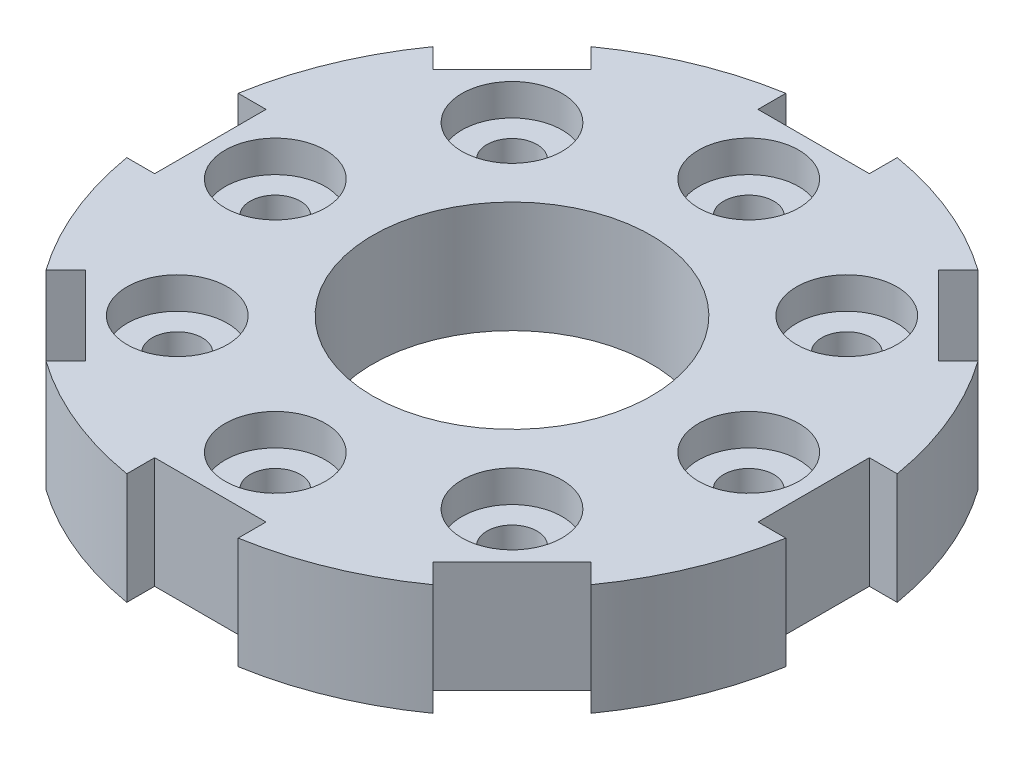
ISO-10303-21;
HEADER;
FILE_DESCRIPTION(('STEP AP214'),'2;1');
FILE_NAME('part.step','',(''),(''),'','','');
FILE_SCHEMA(('AUTOMOTIVE_DESIGN { 1 0 10303 214 1 1 1 1 }'));
ENDSEC;
DATA;
#1=APPLICATION_CONTEXT('core data for automotive mechanical design processes');
#2=APPLICATION_PROTOCOL_DEFINITION('international standard','automotive_design',2000,#1);
#3=PRODUCT_CONTEXT('',#1,'mechanical');
#4=PRODUCT('Part','Part','',(#3));
#5=PRODUCT_RELATED_PRODUCT_CATEGORY('part','',(#4));
#6=PRODUCT_DEFINITION_FORMATION('','',#4);
#7=PRODUCT_DEFINITION_CONTEXT('part definition',#1,'design');
#8=PRODUCT_DEFINITION('design','',#6,#7);
#9=PRODUCT_DEFINITION_SHAPE('','',#8);
#10=(LENGTH_UNIT() NAMED_UNIT(*) SI_UNIT(.MILLI.,.METRE.));
#11=(NAMED_UNIT(*) PLANE_ANGLE_UNIT() SI_UNIT($,.RADIAN.));
#12=(NAMED_UNIT(*) SI_UNIT($,.STERADIAN.) SOLID_ANGLE_UNIT());
#13=UNCERTAINTY_MEASURE_WITH_UNIT(LENGTH_MEASURE(1.E-05),#10,'distance_accuracy_value','');
#14=(GEOMETRIC_REPRESENTATION_CONTEXT(3) GLOBAL_UNCERTAINTY_ASSIGNED_CONTEXT((#13)) GLOBAL_UNIT_ASSIGNED_CONTEXT((#10,
#11,#12)) REPRESENTATION_CONTEXT('',''));
#15=CARTESIAN_POINT('',(0.,0.,0.));
#16=DIRECTION('',(0.,0.,1.));
#17=DIRECTION('',(1.,0.,0.));
#18=AXIS2_PLACEMENT_3D('',#15,#16,#17);
#19=CARTESIAN_POINT('',(0.,20.,0.));
#20=DIRECTION('',(0.,-1.,0.));
#21=DIRECTION('',(0.,0.,-1.));
#22=AXIS2_PLACEMENT_3D('',#19,#20,#21);
#23=CYLINDRICAL_SURFACE('',#22,60.);
#24=CARTESIAN_POINT('',(0.,0.,0.));
#25=DIRECTION('',(0.,1.,0.));
#26=DIRECTION('',(0.,0.,1.));
#27=AXIS2_PLACEMENT_3D('',#24,#25,#26);
#28=CIRCLE('',#27,60.);
#29=CARTESIAN_POINT('',(59.1607978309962,0.,-9.99999999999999));
#30=VERTEX_POINT('',#29);
#31=CARTESIAN_POINT('',(48.9040691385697,0.,-34.7619335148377));
#32=VERTEX_POINT('',#31);
#33=EDGE_CURVE('E296',#30,#32,#28,.T.);
#34=ORIENTED_EDGE('',*,*,#33,.T.);
#35=DIRECTION('',(0.,1.,0.));
#36=VECTOR('',#35,1.);
#37=CARTESIAN_POINT('',(48.9040691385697,0.,-34.7619335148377));
#38=LINE('',#37,#36);
#39=CARTESIAN_POINT('',(48.9040691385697,20.,-34.7619335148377));
#40=VERTEX_POINT('',#39);
#41=EDGE_CURVE('E597',#32,#40,#38,.T.);
#42=ORIENTED_EDGE('',*,*,#41,.T.);
#43=CARTESIAN_POINT('',(0.,20.,0.));
#44=DIRECTION('',(0.,1.,0.));
#45=DIRECTION('',(0.,0.,1.));
#46=AXIS2_PLACEMENT_3D('',#43,#44,#45);
#47=CIRCLE('',#46,60.);
#48=CARTESIAN_POINT('',(59.1607978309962,20.,-9.99999999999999));
#49=VERTEX_POINT('',#48);
#50=EDGE_CURVE('E11',#49,#40,#47,.T.);
#51=ORIENTED_EDGE('',*,*,#50,.F.);
#52=DIRECTION('',(0.,1.,0.));
#53=VECTOR('',#52,1.);
#54=CARTESIAN_POINT('',(59.1607978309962,0.,-9.99999999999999));
#55=LINE('',#54,#53);
#56=EDGE_CURVE('E338',#30,#49,#55,.T.);
#57=ORIENTED_EDGE('',*,*,#56,.F.);
#58=EDGE_LOOP('',(#34,#42,#51,#57));
#59=FACE_BOUND('',#58,.T.);
#60=ADVANCED_FACE('F35',(#59),#23,.T.);
#61=CARTESIAN_POINT('',(34.7619335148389,20.,-48.9040691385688));
#62=VERTEX_POINT('',#61);
#63=CARTESIAN_POINT('',(10.0000000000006,20.,-59.1607978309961));
#64=VERTEX_POINT('',#63);
#65=EDGE_CURVE('E43',#62,#64,#47,.T.);
#66=ORIENTED_EDGE('',*,*,#65,.F.);
#67=DIRECTION('',(0.,1.,0.));
#68=VECTOR('',#67,1.);
#69=CARTESIAN_POINT('',(34.7619335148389,0.,-48.9040691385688));
#70=LINE('',#69,#68);
#71=CARTESIAN_POINT('',(34.7619335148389,0.,-48.9040691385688));
#72=VERTEX_POINT('',#71);
#73=EDGE_CURVE('E245',#72,#62,#70,.T.);
#74=ORIENTED_EDGE('',*,*,#73,.F.);
#75=CARTESIAN_POINT('',(10.0000000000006,0.,-59.1607978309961));
#76=VERTEX_POINT('',#75);
#77=EDGE_CURVE('E302',#72,#76,#28,.T.);
#78=ORIENTED_EDGE('',*,*,#77,.T.);
#79=DIRECTION('',(0.,1.,0.));
#80=VECTOR('',#79,1.);
#81=CARTESIAN_POINT('',(10.0000000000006,0.,-59.1607978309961));
#82=LINE('',#81,#80);
#83=EDGE_CURVE('E270',#76,#64,#82,.T.);
#84=ORIENTED_EDGE('',*,*,#83,.T.);
#85=EDGE_LOOP('',(#66,#74,#78,#84));
#86=FACE_BOUND('',#85,.T.);
#87=ADVANCED_FACE('F268',(#86),#23,.T.);
#88=CARTESIAN_POINT('',(-9.99999999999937,20.,-59.1607978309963));
#89=VERTEX_POINT('',#88);
#90=CARTESIAN_POINT('',(-34.7619335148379,20.,-48.9040691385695));
#91=VERTEX_POINT('',#90);
#92=EDGE_CURVE('E271',#89,#91,#47,.T.);
#93=ORIENTED_EDGE('',*,*,#92,.F.);
#94=DIRECTION('',(0.,1.,0.));
#95=VECTOR('',#94,1.);
#96=CARTESIAN_POINT('',(-9.99999999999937,0.,-59.1607978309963));
#97=LINE('',#96,#95);
#98=CARTESIAN_POINT('',(-9.99999999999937,0.,-59.1607978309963));
#99=VERTEX_POINT('',#98);
#100=EDGE_CURVE('E576',#99,#89,#97,.T.);
#101=ORIENTED_EDGE('',*,*,#100,.F.);
#102=CARTESIAN_POINT('',(-34.7619335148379,0.,-48.9040691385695));
#103=VERTEX_POINT('',#102);
#104=EDGE_CURVE('E308',#99,#103,#28,.T.);
#105=ORIENTED_EDGE('',*,*,#104,.T.);
#106=DIRECTION('',(0.,1.,0.));
#107=VECTOR('',#106,1.);
#108=CARTESIAN_POINT('',(-34.7619335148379,0.,-48.9040691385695));
#109=LINE('',#108,#107);
#110=EDGE_CURVE('E550',#103,#91,#109,.T.);
#111=ORIENTED_EDGE('',*,*,#110,.T.);
#112=EDGE_LOOP('',(#93,#101,#105,#111));
#113=FACE_BOUND('',#112,.T.);
#114=ADVANCED_FACE('F629',(#113),#23,.T.);
#115=CARTESIAN_POINT('',(-48.9040691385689,20.,-34.7619335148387));
#116=VERTEX_POINT('',#115);
#117=CARTESIAN_POINT('',(-59.1607978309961,20.,-10.0000000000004));
#118=VERTEX_POINT('',#117);
#119=EDGE_CURVE('E272',#116,#118,#47,.T.);
#120=ORIENTED_EDGE('',*,*,#119,.F.);
#121=DIRECTION('',(0.,1.,0.));
#122=VECTOR('',#121,1.);
#123=CARTESIAN_POINT('',(-48.9040691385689,0.,-34.7619335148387));
#124=LINE('',#123,#122);
#125=CARTESIAN_POINT('',(-48.9040691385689,0.,-34.7619335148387));
#126=VERTEX_POINT('',#125);
#127=EDGE_CURVE('E551',#126,#116,#124,.T.);
#128=ORIENTED_EDGE('',*,*,#127,.F.);
#129=CARTESIAN_POINT('',(-59.1607978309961,0.,-10.0000000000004));
#130=VERTEX_POINT('',#129);
#131=EDGE_CURVE('E632',#126,#130,#28,.T.);
#132=ORIENTED_EDGE('',*,*,#131,.T.);
#133=DIRECTION('',(0.,1.,0.));
#134=VECTOR('',#133,1.);
#135=CARTESIAN_POINT('',(-59.1607978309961,0.,-10.0000000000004));
#136=LINE('',#135,#134);
#137=EDGE_CURVE('E524',#130,#118,#136,.T.);
#138=ORIENTED_EDGE('',*,*,#137,.T.);
#139=EDGE_LOOP('',(#120,#128,#132,#138));
#140=FACE_BOUND('',#139,.T.);
#141=ADVANCED_FACE('F712',(#140),#23,.T.);
#142=CARTESIAN_POINT('',(-59.1607978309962,20.,9.99999999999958));
#143=VERTEX_POINT('',#142);
#144=CARTESIAN_POINT('',(-48.9040691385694,20.,34.761933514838));
#145=VERTEX_POINT('',#144);
#146=EDGE_CURVE('E277',#143,#145,#47,.T.);
#147=ORIENTED_EDGE('',*,*,#146,.F.);
#148=DIRECTION('',(0.,1.,0.));
#149=VECTOR('',#148,1.);
#150=CARTESIAN_POINT('',(-59.1607978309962,0.,9.99999999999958));
#151=LINE('',#150,#149);
#152=CARTESIAN_POINT('',(-59.1607978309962,0.,9.99999999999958));
#153=VERTEX_POINT('',#152);
#154=EDGE_CURVE('E525',#153,#143,#151,.T.);
#155=ORIENTED_EDGE('',*,*,#154,.F.);
#156=CARTESIAN_POINT('',(-48.9040691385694,0.,34.761933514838));
#157=VERTEX_POINT('',#156);
#158=EDGE_CURVE('E633',#153,#157,#28,.T.);
#159=ORIENTED_EDGE('',*,*,#158,.T.);
#160=DIRECTION('',(0.,1.,0.));
#161=VECTOR('',#160,1.);
#162=CARTESIAN_POINT('',(-48.9040691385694,0.,34.761933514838));
#163=LINE('',#162,#161);
#164=EDGE_CURVE('E498',#157,#145,#163,.T.);
#165=ORIENTED_EDGE('',*,*,#164,.T.);
#166=EDGE_LOOP('',(#147,#155,#159,#165));
#167=FACE_BOUND('',#166,.T.);
#168=ADVANCED_FACE('F708',(#167),#23,.T.);
#169=CARTESIAN_POINT('',(-34.7619335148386,20.,48.9040691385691));
#170=VERTEX_POINT('',#169);
#171=CARTESIAN_POINT('',(-10.0000000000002,20.,59.1607978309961));
#172=VERTEX_POINT('',#171);
#173=EDGE_CURVE('E282',#170,#172,#47,.T.);
#174=ORIENTED_EDGE('',*,*,#173,.F.);
#175=DIRECTION('',(0.,1.,0.));
#176=VECTOR('',#175,1.);
#177=CARTESIAN_POINT('',(-34.7619335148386,0.,48.9040691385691));
#178=LINE('',#177,#176);
#179=CARTESIAN_POINT('',(-34.7619335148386,0.,48.9040691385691));
#180=VERTEX_POINT('',#179);
#181=EDGE_CURVE('E499',#180,#170,#178,.T.);
#182=ORIENTED_EDGE('',*,*,#181,.F.);
#183=CARTESIAN_POINT('',(-10.0000000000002,0.,59.1607978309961));
#184=VERTEX_POINT('',#183);
#185=EDGE_CURVE('E317',#180,#184,#28,.T.);
#186=ORIENTED_EDGE('',*,*,#185,.T.);
#187=DIRECTION('',(0.,1.,0.));
#188=VECTOR('',#187,1.);
#189=CARTESIAN_POINT('',(-10.0000000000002,0.,59.1607978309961));
#190=LINE('',#189,#188);
#191=EDGE_CURVE('E472',#184,#172,#190,.T.);
#192=ORIENTED_EDGE('',*,*,#191,.T.);
#193=EDGE_LOOP('',(#174,#182,#186,#192));
#194=FACE_BOUND('',#193,.T.);
#195=ADVANCED_FACE('F646',(#194),#23,.T.);
#196=CARTESIAN_POINT('',(9.99999999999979,20.,59.1607978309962));
#197=VERTEX_POINT('',#196);
#198=CARTESIAN_POINT('',(34.7619335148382,20.,48.9040691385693));
#199=VERTEX_POINT('',#198);
#200=EDGE_CURVE('E287',#197,#199,#47,.T.);
#201=ORIENTED_EDGE('',*,*,#200,.F.);
#202=DIRECTION('',(0.,1.,0.));
#203=VECTOR('',#202,1.);
#204=CARTESIAN_POINT('',(9.99999999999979,0.,59.1607978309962));
#205=LINE('',#204,#203);
#206=CARTESIAN_POINT('',(9.99999999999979,0.,59.1607978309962));
#207=VERTEX_POINT('',#206);
#208=EDGE_CURVE('E473',#207,#197,#205,.T.);
#209=ORIENTED_EDGE('',*,*,#208,.F.);
#210=CARTESIAN_POINT('',(34.7619335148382,0.,48.9040691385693));
#211=VERTEX_POINT('',#210);
#212=EDGE_CURVE('E310',#207,#211,#28,.T.);
#213=ORIENTED_EDGE('',*,*,#212,.T.);
#214=DIRECTION('',(0.,1.,0.));
#215=VECTOR('',#214,1.);
#216=CARTESIAN_POINT('',(34.7619335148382,0.,48.9040691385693));
#217=LINE('',#216,#215);
#218=EDGE_CURVE('E446',#211,#199,#217,.T.);
#219=ORIENTED_EDGE('',*,*,#218,.T.);
#220=EDGE_LOOP('',(#201,#209,#213,#219));
#221=FACE_BOUND('',#220,.T.);
#222=ADVANCED_FACE('F659',(#221),#23,.T.);
#223=CARTESIAN_POINT('',(0.,20.,0.));
#224=DIRECTION('',(0.,1.,0.));
#225=DIRECTION('',(0.,0.,1.));
#226=AXIS2_PLACEMENT_3D('',#223,#224,#225);
#227=PLANE('',#226);
#228=DIRECTION('',(0.707106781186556,0.,-0.707106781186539));
#229=VECTOR('',#228,1.);
#230=CARTESIAN_POINT('',(45.3685352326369,20.,-31.226399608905));
#231=LINE('',#230,#229);
#232=CARTESIAN_POINT('',(45.3685352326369,20.,-31.226399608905));
#233=VERTEX_POINT('',#232);
#234=EDGE_CURVE('E607',#233,#40,#231,.T.);
#235=ORIENTED_EDGE('',*,*,#234,.F.);
#236=DIRECTION('',(0.707106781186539,0.,0.707106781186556));
#237=VECTOR('',#236,1.);
#238=CARTESIAN_POINT('',(31.2263996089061,20.,-45.3685352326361));
#239=LINE('',#238,#237);
#240=CARTESIAN_POINT('',(31.2263996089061,20.,-45.3685352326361));
#241=VERTEX_POINT('',#240);
#242=EDGE_CURVE('E265',#241,#233,#239,.T.);
#243=ORIENTED_EDGE('',*,*,#242,.F.);
#244=DIRECTION('',(-0.707106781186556,0.,0.707106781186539));
#245=VECTOR('',#244,1.);
#246=CARTESIAN_POINT('',(31.2263996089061,20.,-45.3685352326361));
#247=LINE('',#246,#245);
#248=EDGE_CURVE('E248',#62,#241,#247,.T.);
#249=ORIENTED_EDGE('',*,*,#248,.F.);
#250=ORIENTED_EDGE('',*,*,#65,.T.);
#251=DIRECTION('',(0.,0.,-1.));
#252=VECTOR('',#251,1.);
#253=CARTESIAN_POINT('',(10.0000000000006,20.,-54.1607978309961));
#254=LINE('',#253,#252);
#255=CARTESIAN_POINT('',(10.0000000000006,20.,-54.1607978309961));
#256=VERTEX_POINT('',#255);
#257=EDGE_CURVE('E590',#256,#64,#254,.T.);
#258=ORIENTED_EDGE('',*,*,#257,.F.);
#259=DIRECTION('',(1.,0.,0.));
#260=VECTOR('',#259,1.);
#261=CARTESIAN_POINT('',(-9.99999999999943,20.,-54.1607978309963));
#262=LINE('',#261,#260);
#263=CARTESIAN_POINT('',(-9.99999999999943,20.,-54.1607978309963));
#264=VERTEX_POINT('',#263);
#265=EDGE_CURVE('E592',#264,#256,#262,.T.);
#266=ORIENTED_EDGE('',*,*,#265,.F.);
#267=DIRECTION('',(0.,0.,1.));
#268=VECTOR('',#267,1.);
#269=CARTESIAN_POINT('',(-9.99999999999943,20.,-54.1607978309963));
#270=LINE('',#269,#268);
#271=EDGE_CURVE('E595',#89,#264,#270,.T.);
#272=ORIENTED_EDGE('',*,*,#271,.F.);
#273=ORIENTED_EDGE('',*,*,#92,.T.);
#274=DIRECTION('',(-0.707106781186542,0.,-0.707106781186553));
#275=VECTOR('',#274,1.);
#276=CARTESIAN_POINT('',(-31.2263996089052,20.,-45.3685352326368));
#277=LINE('',#276,#275);
#278=CARTESIAN_POINT('',(-31.2263996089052,20.,-45.3685352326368));
#279=VERTEX_POINT('',#278);
#280=EDGE_CURVE('E568',#279,#91,#277,.T.);
#281=ORIENTED_EDGE('',*,*,#280,.F.);
#282=DIRECTION('',(0.707106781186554,0.,-0.707106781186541));
#283=VECTOR('',#282,1.);
#284=CARTESIAN_POINT('',(-45.3685352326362,20.,-31.226399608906));
#285=LINE('',#284,#283);
#286=CARTESIAN_POINT('',(-45.3685352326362,20.,-31.226399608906));
#287=VERTEX_POINT('',#286);
#288=EDGE_CURVE('E570',#287,#279,#285,.T.);
#289=ORIENTED_EDGE('',*,*,#288,.F.);
#290=DIRECTION('',(0.707106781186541,0.,0.707106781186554));
#291=VECTOR('',#290,1.);
#292=CARTESIAN_POINT('',(-45.3685352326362,20.,-31.226399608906));
#293=LINE('',#292,#291);
#294=EDGE_CURVE('E573',#116,#287,#293,.T.);
#295=ORIENTED_EDGE('',*,*,#294,.F.);
#296=ORIENTED_EDGE('',*,*,#119,.T.);
#297=DIRECTION('',(-1.,0.,0.));
#298=VECTOR('',#297,1.);
#299=CARTESIAN_POINT('',(-54.1607978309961,20.,-10.0000000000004));
#300=LINE('',#299,#298);
#301=CARTESIAN_POINT('',(-54.1607978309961,20.,-10.0000000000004));
#302=VERTEX_POINT('',#301);
#303=EDGE_CURVE('E542',#302,#118,#300,.T.);
#304=ORIENTED_EDGE('',*,*,#303,.F.);
#305=DIRECTION('',(0.,0.,-1.));
#306=VECTOR('',#305,1.);
#307=CARTESIAN_POINT('',(-54.1607978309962,20.,9.99999999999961));
#308=LINE('',#307,#306);
#309=CARTESIAN_POINT('',(-54.1607978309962,20.,9.99999999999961));
#310=VERTEX_POINT('',#309);
#311=EDGE_CURVE('E544',#310,#302,#308,.T.);
#312=ORIENTED_EDGE('',*,*,#311,.F.);
#313=DIRECTION('',(1.,0.,0.));
#314=VECTOR('',#313,1.);
#315=CARTESIAN_POINT('',(-54.1607978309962,20.,9.99999999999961));
#316=LINE('',#315,#314);
#317=EDGE_CURVE('E547',#143,#310,#316,.T.);
#318=ORIENTED_EDGE('',*,*,#317,.F.);
#319=ORIENTED_EDGE('',*,*,#146,.T.);
#320=DIRECTION('',(-0.707106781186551,0.,0.707106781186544));
#321=VECTOR('',#320,1.);
#322=CARTESIAN_POINT('',(-45.3685352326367,20.,31.2263996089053));
#323=LINE('',#322,#321);
#324=CARTESIAN_POINT('',(-45.3685352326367,20.,31.2263996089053));
#325=VERTEX_POINT('',#324);
#326=EDGE_CURVE('E516',#325,#145,#323,.T.);
#327=ORIENTED_EDGE('',*,*,#326,.F.);
#328=DIRECTION('',(-0.707106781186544,0.,-0.707106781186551));
#329=VECTOR('',#328,1.);
#330=CARTESIAN_POINT('',(-31.2263996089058,20.,45.3685352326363));
#331=LINE('',#330,#329);
#332=CARTESIAN_POINT('',(-31.2263996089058,20.,45.3685352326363));
#333=VERTEX_POINT('',#332);
#334=EDGE_CURVE('E518',#333,#325,#331,.T.);
#335=ORIENTED_EDGE('',*,*,#334,.F.);
#336=DIRECTION('',(0.707106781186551,0.,-0.707106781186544));
#337=VECTOR('',#336,1.);
#338=CARTESIAN_POINT('',(-31.2263996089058,20.,45.3685352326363));
#339=LINE('',#338,#337);
#340=EDGE_CURVE('E521',#170,#333,#339,.T.);
#341=ORIENTED_EDGE('',*,*,#340,.F.);
#342=ORIENTED_EDGE('',*,*,#173,.T.);
#343=DIRECTION('',(0.,0.,1.));
#344=VECTOR('',#343,1.);
#345=CARTESIAN_POINT('',(-10.0000000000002,20.,54.1607978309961));
#346=LINE('',#345,#344);
#347=CARTESIAN_POINT('',(-10.0000000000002,20.,54.1607978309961));
#348=VERTEX_POINT('',#347);
#349=EDGE_CURVE('E490',#348,#172,#346,.T.);
#350=ORIENTED_EDGE('',*,*,#349,.F.);
#351=DIRECTION('',(-1.,0.,0.));
#352=VECTOR('',#351,1.);
#353=CARTESIAN_POINT('',(9.9999999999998,20.,54.1607978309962));
#354=LINE('',#353,#352);
#355=CARTESIAN_POINT('',(9.9999999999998,20.,54.1607978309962));
#356=VERTEX_POINT('',#355);
#357=EDGE_CURVE('E492',#356,#348,#354,.T.);
#358=ORIENTED_EDGE('',*,*,#357,.F.);
#359=DIRECTION('',(0.,0.,-1.));
#360=VECTOR('',#359,1.);
#361=CARTESIAN_POINT('',(9.9999999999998,20.,54.1607978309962));
#362=LINE('',#361,#360);
#363=EDGE_CURVE('E495',#197,#356,#362,.T.);
#364=ORIENTED_EDGE('',*,*,#363,.F.);
#365=ORIENTED_EDGE('',*,*,#200,.T.);
#366=DIRECTION('',(0.707106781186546,0.,0.707106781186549));
#367=VECTOR('',#366,1.);
#368=CARTESIAN_POINT('',(31.2263996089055,20.,45.3685352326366));
#369=LINE('',#368,#367);
#370=CARTESIAN_POINT('',(31.2263996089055,20.,45.3685352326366));
#371=VERTEX_POINT('',#370);
#372=EDGE_CURVE('E464',#371,#199,#369,.T.);
#373=ORIENTED_EDGE('',*,*,#372,.F.);
#374=DIRECTION('',(-0.707106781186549,0.,0.707106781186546));
#375=VECTOR('',#374,1.);
#376=CARTESIAN_POINT('',(45.3685352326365,20.,31.2263996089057));
#377=LINE('',#376,#375);
#378=CARTESIAN_POINT('',(45.3685352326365,20.,31.2263996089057));
#379=VERTEX_POINT('',#378);
#380=EDGE_CURVE('E466',#379,#371,#377,.T.);
#381=ORIENTED_EDGE('',*,*,#380,.F.);
#382=DIRECTION('',(-0.707106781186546,0.,-0.707106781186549));
#383=VECTOR('',#382,1.);
#384=CARTESIAN_POINT('',(45.3685352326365,20.,31.2263996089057));
#385=LINE('',#384,#383);
#386=CARTESIAN_POINT('',(48.9040691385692,20.,34.7619335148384));
#387=VERTEX_POINT('',#386);
#388=EDGE_CURVE('E469',#387,#379,#385,.T.);
#389=ORIENTED_EDGE('',*,*,#388,.F.);
#390=CARTESIAN_POINT('',(59.1607978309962,20.,9.99999999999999));
#391=VERTEX_POINT('',#390);
#392=EDGE_CURVE('E44',#387,#391,#47,.T.);
#393=ORIENTED_EDGE('',*,*,#392,.T.);
#394=DIRECTION('',(1.,0.,0.));
#395=VECTOR('',#394,1.);
#396=CARTESIAN_POINT('',(54.1607978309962,20.,9.99999999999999));
#397=LINE('',#396,#395);
#398=CARTESIAN_POINT('',(54.1607978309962,20.,9.99999999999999));
#399=VERTEX_POINT('',#398);
#400=EDGE_CURVE('E354',#399,#391,#397,.T.);
#401=ORIENTED_EDGE('',*,*,#400,.F.);
#402=DIRECTION('',(0.,0.,1.));
#403=VECTOR('',#402,1.);
#404=CARTESIAN_POINT('',(54.1607978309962,20.,-9.99999999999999));
#405=LINE('',#404,#403);
#406=CARTESIAN_POINT('',(54.1607978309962,20.,-9.99999999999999));
#407=VERTEX_POINT('',#406);
#408=EDGE_CURVE('E356',#407,#399,#405,.T.);
#409=ORIENTED_EDGE('',*,*,#408,.F.);
#410=DIRECTION('',(-1.,0.,0.));
#411=VECTOR('',#410,1.);
#412=CARTESIAN_POINT('',(54.1607978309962,20.,-9.99999999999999));
#413=LINE('',#412,#411);
#414=EDGE_CURVE('E359',#49,#407,#413,.T.);
#415=ORIENTED_EDGE('',*,*,#414,.F.);
#416=ORIENTED_EDGE('',*,*,#50,.T.);
#417=EDGE_LOOP('',(#235,#243,#249,#250,#258,#266,#272,#273,#281,#289,#295,#296,#304,#312,#318,
#319,#327,#335,#341,#342,#350,#358,#364,#365,#373,#381,#389,#393,#401,#409,#415,#416));
#418=FACE_BOUND('',#417,.T.);
#419=CARTESIAN_POINT('',(30.0520382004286,20.,-30.0520382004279));
#420=DIRECTION('',(0.,1.,0.));
#421=DIRECTION('',(0.,0.,1.));
#422=AXIS2_PLACEMENT_3D('',#419,#420,#421);
#423=CIRCLE('',#422,9.005);
#424=CARTESIAN_POINT('',(30.0520382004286,20.,-21.0470382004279));
#425=VERTEX_POINT('',#424);
#426=EDGE_CURVE('E434',#425,#425,#423,.T.);
#427=ORIENTED_EDGE('',*,*,#426,.F.);
#428=EDGE_LOOP('',(#427));
#429=FACE_BOUND('',#428,.T.);
#430=CARTESIAN_POINT('',(4.45164128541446E-13,20.,-42.5));
#431=DIRECTION('',(0.,1.,0.));
#432=DIRECTION('',(0.,0.,1.));
#433=AXIS2_PLACEMENT_3D('',#430,#431,#432);
#434=CIRCLE('',#433,9.005);
#435=CARTESIAN_POINT('',(4.45164128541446E-13,20.,-33.495));
#436=VERTEX_POINT('',#435);
#437=EDGE_CURVE('E422',#436,#436,#434,.T.);
#438=ORIENTED_EDGE('',*,*,#437,.F.);
#439=EDGE_LOOP('',(#438));
#440=FACE_BOUND('',#439,.T.);
#441=CARTESIAN_POINT('',(-30.052038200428,20.,-30.0520382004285));
#442=DIRECTION('',(0.,1.,0.));
#443=DIRECTION('',(0.,0.,1.));
#444=AXIS2_PLACEMENT_3D('',#441,#442,#443);
#445=CIRCLE('',#444,9.005);
#446=CARTESIAN_POINT('',(-30.052038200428,20.,-21.0470382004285));
#447=VERTEX_POINT('',#446);
#448=EDGE_CURVE('E410',#447,#447,#445,.T.);
#449=ORIENTED_EDGE('',*,*,#448,.F.);
#450=EDGE_LOOP('',(#449));
#451=FACE_BOUND('',#450,.T.);
#452=CARTESIAN_POINT('',(-42.5,20.,-2.96776085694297E-13));
#453=DIRECTION('',(0.,1.,0.));
#454=DIRECTION('',(0.,0.,1.));
#455=AXIS2_PLACEMENT_3D('',#452,#453,#454);
#456=CIRCLE('',#455,9.005);
#457=CARTESIAN_POINT('',(-42.5,20.,9.0049999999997));
#458=VERTEX_POINT('',#457);
#459=EDGE_CURVE('E398',#458,#458,#456,.T.);
#460=ORIENTED_EDGE('',*,*,#459,.F.);
#461=EDGE_LOOP('',(#460));
#462=FACE_BOUND('',#461,.T.);
#463=CARTESIAN_POINT('',(-30.0520382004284,20.,30.0520382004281));
#464=DIRECTION('',(0.,1.,0.));
#465=DIRECTION('',(0.,0.,1.));
#466=AXIS2_PLACEMENT_3D('',#463,#464,#465);
#467=CIRCLE('',#466,9.005);
#468=CARTESIAN_POINT('',(-30.0520382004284,20.,39.0570382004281));
#469=VERTEX_POINT('',#468);
#470=EDGE_CURVE('E386',#469,#469,#467,.T.);
#471=ORIENTED_EDGE('',*,*,#470,.F.);
#472=EDGE_LOOP('',(#471));
#473=FACE_BOUND('',#472,.T.);
#474=CARTESIAN_POINT('',(-1.48388042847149E-13,20.,42.5));
#475=DIRECTION('',(0.,1.,0.));
#476=DIRECTION('',(0.,0.,1.));
#477=AXIS2_PLACEMENT_3D('',#474,#475,#476);
#478=CIRCLE('',#477,9.005);
#479=CARTESIAN_POINT('',(-1.48388042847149E-13,20.,51.505));
#480=VERTEX_POINT('',#479);
#481=EDGE_CURVE('E374',#480,#480,#478,.T.);
#482=ORIENTED_EDGE('',*,*,#481,.F.);
#483=EDGE_LOOP('',(#482));
#484=FACE_BOUND('',#483,.T.);
#485=CARTESIAN_POINT('',(30.0520382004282,20.,30.0520382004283));
#486=DIRECTION('',(0.,1.,0.));
#487=DIRECTION('',(0.,0.,1.));
#488=AXIS2_PLACEMENT_3D('',#485,#486,#487);
#489=CIRCLE('',#488,9.005);
#490=CARTESIAN_POINT('',(30.0520382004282,20.,39.0570382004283));
#491=VERTEX_POINT('',#490);
#492=EDGE_CURVE('E362',#491,#491,#489,.T.);
#493=ORIENTED_EDGE('',*,*,#492,.F.);
#494=EDGE_LOOP('',(#493));
#495=FACE_BOUND('',#494,.T.);
#496=CARTESIAN_POINT('',(42.5,20.,0.));
#497=DIRECTION('',(0.,1.,0.));
#498=DIRECTION('',(0.,0.,1.));
#499=AXIS2_PLACEMENT_3D('',#496,#497,#498);
#500=CIRCLE('',#499,9.005);
#501=CARTESIAN_POINT('',(42.5,20.,9.005));
#502=VERTEX_POINT('',#501);
#503=EDGE_CURVE('E323',#502,#502,#500,.T.);
#504=ORIENTED_EDGE('',*,*,#503,.F.);
#505=EDGE_LOOP('',(#504));
#506=FACE_BOUND('',#505,.T.);
#507=CARTESIAN_POINT('',(0.,20.,0.));
#508=DIRECTION('',(0.,1.,0.));
#509=DIRECTION('',(0.,0.,1.));
#510=AXIS2_PLACEMENT_3D('',#507,#508,#509);
#511=CIRCLE('',#510,25.);
#512=CARTESIAN_POINT('',(0.,20.,25.));
#513=VERTEX_POINT('',#512);
#514=EDGE_CURVE('E311',#513,#513,#511,.T.);
#515=ORIENTED_EDGE('',*,*,#514,.F.);
#516=EDGE_LOOP('',(#515));
#517=FACE_BOUND('',#516,.T.);
#518=ADVANCED_FACE('F260',(#418,#429,#440,#451,#462,#473,#484,#495,#506,#517),#227,.T.);
#519=CARTESIAN_POINT('',(0.,0.,0.));
#520=DIRECTION('',(0.,1.,0.));
#521=DIRECTION('',(0.,0.,1.));
#522=AXIS2_PLACEMENT_3D('',#519,#520,#521);
#523=PLANE('',#522);
#524=CARTESIAN_POINT('',(30.0520382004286,0.,-30.0520382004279));
#525=DIRECTION('',(0.,1.,0.));
#526=DIRECTION('',(0.,0.,1.));
#527=AXIS2_PLACEMENT_3D('',#524,#525,#526);
#528=CIRCLE('',#527,4.49999999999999);
#529=CARTESIAN_POINT('',(30.0520382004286,0.,-25.5520382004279));
#530=VERTEX_POINT('',#529);
#531=EDGE_CURVE('E443',#530,#530,#528,.T.);
#532=ORIENTED_EDGE('',*,*,#531,.T.);
#533=EDGE_LOOP('',(#532));
#534=FACE_BOUND('',#533,.T.);
#535=CARTESIAN_POINT('',(4.45164128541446E-13,0.,-42.5));
#536=DIRECTION('',(0.,1.,0.));
#537=DIRECTION('',(0.,0.,1.));
#538=AXIS2_PLACEMENT_3D('',#535,#536,#537);
#539=CIRCLE('',#538,4.5);
#540=CARTESIAN_POINT('',(4.45164128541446E-13,0.,-38.));
#541=VERTEX_POINT('',#540);
#542=EDGE_CURVE('E431',#541,#541,#539,.T.);
#543=ORIENTED_EDGE('',*,*,#542,.T.);
#544=EDGE_LOOP('',(#543));
#545=FACE_BOUND('',#544,.T.);
#546=CARTESIAN_POINT('',(-30.052038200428,0.,-30.0520382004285));
#547=DIRECTION('',(0.,1.,0.));
#548=DIRECTION('',(0.,0.,1.));
#549=AXIS2_PLACEMENT_3D('',#546,#547,#548);
#550=CIRCLE('',#549,4.5);
#551=CARTESIAN_POINT('',(-30.052038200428,0.,-25.5520382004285));
#552=VERTEX_POINT('',#551);
#553=EDGE_CURVE('E419',#552,#552,#550,.T.);
#554=ORIENTED_EDGE('',*,*,#553,.T.);
#555=EDGE_LOOP('',(#554));
#556=FACE_BOUND('',#555,.T.);
#557=CARTESIAN_POINT('',(-42.5,0.,-2.96776085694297E-13));
#558=DIRECTION('',(0.,1.,0.));
#559=DIRECTION('',(0.,0.,1.));
#560=AXIS2_PLACEMENT_3D('',#557,#558,#559);
#561=CIRCLE('',#560,4.5);
#562=CARTESIAN_POINT('',(-42.5,0.,4.4999999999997));
#563=VERTEX_POINT('',#562);
#564=EDGE_CURVE('E407',#563,#563,#561,.T.);
#565=ORIENTED_EDGE('',*,*,#564,.T.);
#566=EDGE_LOOP('',(#565));
#567=FACE_BOUND('',#566,.T.);
#568=CARTESIAN_POINT('',(-30.0520382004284,0.,30.0520382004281));
#569=DIRECTION('',(0.,1.,0.));
#570=DIRECTION('',(0.,0.,1.));
#571=AXIS2_PLACEMENT_3D('',#568,#569,#570);
#572=CIRCLE('',#571,4.49999999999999);
#573=CARTESIAN_POINT('',(-30.0520382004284,0.,34.5520382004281));
#574=VERTEX_POINT('',#573);
#575=EDGE_CURVE('E395',#574,#574,#572,.T.);
#576=ORIENTED_EDGE('',*,*,#575,.T.);
#577=EDGE_LOOP('',(#576));
#578=FACE_BOUND('',#577,.T.);
#579=CARTESIAN_POINT('',(-1.48388042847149E-13,0.,42.5));
#580=DIRECTION('',(0.,1.,0.));
#581=DIRECTION('',(0.,0.,1.));
#582=AXIS2_PLACEMENT_3D('',#579,#580,#581);
#583=CIRCLE('',#582,4.5);
#584=CARTESIAN_POINT('',(-1.48388042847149E-13,0.,47.));
#585=VERTEX_POINT('',#584);
#586=EDGE_CURVE('E383',#585,#585,#583,.T.);
#587=ORIENTED_EDGE('',*,*,#586,.T.);
#588=EDGE_LOOP('',(#587));
#589=FACE_BOUND('',#588,.T.);
#590=CARTESIAN_POINT('',(30.0520382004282,0.,30.0520382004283));
#591=DIRECTION('',(0.,1.,0.));
#592=DIRECTION('',(0.,0.,1.));
#593=AXIS2_PLACEMENT_3D('',#590,#591,#592);
#594=CIRCLE('',#593,4.5);
#595=CARTESIAN_POINT('',(30.0520382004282,0.,34.5520382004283));
#596=VERTEX_POINT('',#595);
#597=EDGE_CURVE('E371',#596,#596,#594,.T.);
#598=ORIENTED_EDGE('',*,*,#597,.T.);
#599=EDGE_LOOP('',(#598));
#600=FACE_BOUND('',#599,.T.);
#601=CARTESIAN_POINT('',(42.5,0.,0.));
#602=DIRECTION('',(0.,1.,0.));
#603=DIRECTION('',(0.,0.,1.));
#604=AXIS2_PLACEMENT_3D('',#601,#602,#603);
#605=CIRCLE('',#604,4.5);
#606=CARTESIAN_POINT('',(42.5,0.,4.5));
#607=VERTEX_POINT('',#606);
#608=EDGE_CURVE('E334',#607,#607,#605,.T.);
#609=ORIENTED_EDGE('',*,*,#608,.T.);
#610=EDGE_LOOP('',(#609));
#611=FACE_BOUND('',#610,.T.);
#612=DIRECTION('',(0.707106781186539,0.,0.707106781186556));
#613=VECTOR('',#612,1.);
#614=CARTESIAN_POINT('',(31.2263996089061,0.,-45.3685352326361));
#615=LINE('',#614,#613);
#616=CARTESIAN_POINT('',(31.2263996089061,0.,-45.3685352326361));
#617=VERTEX_POINT('',#616);
#618=CARTESIAN_POINT('',(45.3685352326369,0.,-31.226399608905));
#619=VERTEX_POINT('',#618);
#620=EDGE_CURVE('E51',#617,#619,#615,.T.);
#621=ORIENTED_EDGE('',*,*,#620,.T.);
#622=DIRECTION('',(0.707106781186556,0.,-0.707106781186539));
#623=VECTOR('',#622,1.);
#624=CARTESIAN_POINT('',(45.3685352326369,0.,-31.226399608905));
#625=LINE('',#624,#623);
#626=EDGE_CURVE('E256',#619,#32,#625,.T.);
#627=ORIENTED_EDGE('',*,*,#626,.T.);
#628=ORIENTED_EDGE('',*,*,#33,.F.);
#629=DIRECTION('',(-1.,0.,0.));
#630=VECTOR('',#629,1.);
#631=CARTESIAN_POINT('',(54.1607978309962,0.,-9.99999999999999));
#632=LINE('',#631,#630);
#633=CARTESIAN_POINT('',(54.1607978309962,0.,-9.99999999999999));
#634=VERTEX_POINT('',#633);
#635=EDGE_CURVE('E351',#30,#634,#632,.T.);
#636=ORIENTED_EDGE('',*,*,#635,.T.);
#637=DIRECTION('',(0.,0.,1.));
#638=VECTOR('',#637,1.);
#639=CARTESIAN_POINT('',(54.1607978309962,0.,-9.99999999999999));
#640=LINE('',#639,#638);
#641=CARTESIAN_POINT('',(54.1607978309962,0.,9.99999999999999));
#642=VERTEX_POINT('',#641);
#643=EDGE_CURVE('E348',#634,#642,#640,.T.);
#644=ORIENTED_EDGE('',*,*,#643,.T.);
#645=DIRECTION('',(1.,0.,0.));
#646=VECTOR('',#645,1.);
#647=CARTESIAN_POINT('',(54.1607978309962,0.,9.99999999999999));
#648=LINE('',#647,#646);
#649=CARTESIAN_POINT('',(59.1607978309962,0.,9.99999999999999));
#650=VERTEX_POINT('',#649);
#651=EDGE_CURVE('E341',#642,#650,#648,.T.);
#652=ORIENTED_EDGE('',*,*,#651,.T.);
#653=CARTESIAN_POINT('',(48.9040691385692,0.,34.7619335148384));
#654=VERTEX_POINT('',#653);
#655=EDGE_CURVE('E303',#654,#650,#28,.T.);
#656=ORIENTED_EDGE('',*,*,#655,.F.);
#657=DIRECTION('',(-0.707106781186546,0.,-0.707106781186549));
#658=VECTOR('',#657,1.);
#659=CARTESIAN_POINT('',(45.3685352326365,0.,31.2263996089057));
#660=LINE('',#659,#658);
#661=CARTESIAN_POINT('',(45.3685352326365,0.,31.2263996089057));
#662=VERTEX_POINT('',#661);
#663=EDGE_CURVE('E461',#654,#662,#660,.T.);
#664=ORIENTED_EDGE('',*,*,#663,.T.);
#665=DIRECTION('',(-0.707106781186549,0.,0.707106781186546));
#666=VECTOR('',#665,1.);
#667=CARTESIAN_POINT('',(45.3685352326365,0.,31.2263996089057));
#668=LINE('',#667,#666);
#669=CARTESIAN_POINT('',(31.2263996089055,0.,45.3685352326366));
#670=VERTEX_POINT('',#669);
#671=EDGE_CURVE('E458',#662,#670,#668,.T.);
#672=ORIENTED_EDGE('',*,*,#671,.T.);
#673=DIRECTION('',(0.707106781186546,0.,0.707106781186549));
#674=VECTOR('',#673,1.);
#675=CARTESIAN_POINT('',(31.2263996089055,0.,45.3685352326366));
#676=LINE('',#675,#674);
#677=EDGE_CURVE('E450',#670,#211,#676,.T.);
#678=ORIENTED_EDGE('',*,*,#677,.T.);
#679=ORIENTED_EDGE('',*,*,#212,.F.);
#680=DIRECTION('',(0.,0.,-1.));
#681=VECTOR('',#680,1.);
#682=CARTESIAN_POINT('',(9.9999999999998,0.,54.1607978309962));
#683=LINE('',#682,#681);
#684=CARTESIAN_POINT('',(9.9999999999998,0.,54.1607978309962));
#685=VERTEX_POINT('',#684);
#686=EDGE_CURVE('E487',#207,#685,#683,.T.);
#687=ORIENTED_EDGE('',*,*,#686,.T.);
#688=DIRECTION('',(-1.,0.,0.));
#689=VECTOR('',#688,1.);
#690=CARTESIAN_POINT('',(9.9999999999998,0.,54.1607978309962));
#691=LINE('',#690,#689);
#692=CARTESIAN_POINT('',(-10.0000000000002,0.,54.1607978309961));
#693=VERTEX_POINT('',#692);
#694=EDGE_CURVE('E484',#685,#693,#691,.T.);
#695=ORIENTED_EDGE('',*,*,#694,.T.);
#696=DIRECTION('',(0.,0.,1.));
#697=VECTOR('',#696,1.);
#698=CARTESIAN_POINT('',(-10.0000000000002,0.,54.1607978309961));
#699=LINE('',#698,#697);
#700=EDGE_CURVE('E476',#693,#184,#699,.T.);
#701=ORIENTED_EDGE('',*,*,#700,.T.);
#702=ORIENTED_EDGE('',*,*,#185,.F.);
#703=DIRECTION('',(0.707106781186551,0.,-0.707106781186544));
#704=VECTOR('',#703,1.);
#705=CARTESIAN_POINT('',(-31.2263996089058,0.,45.3685352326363));
#706=LINE('',#705,#704);
#707=CARTESIAN_POINT('',(-31.2263996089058,0.,45.3685352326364));
#708=VERTEX_POINT('',#707);
#709=EDGE_CURVE('E513',#180,#708,#706,.T.);
#710=ORIENTED_EDGE('',*,*,#709,.T.);
#711=DIRECTION('',(-0.707106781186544,0.,-0.707106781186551));
#712=VECTOR('',#711,1.);
#713=CARTESIAN_POINT('',(-31.2263996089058,0.,45.3685352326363));
#714=LINE('',#713,#712);
#715=CARTESIAN_POINT('',(-45.3685352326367,0.,31.2263996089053));
#716=VERTEX_POINT('',#715);
#717=EDGE_CURVE('E510',#708,#716,#714,.T.);
#718=ORIENTED_EDGE('',*,*,#717,.T.);
#719=DIRECTION('',(-0.707106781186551,0.,0.707106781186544));
#720=VECTOR('',#719,1.);
#721=CARTESIAN_POINT('',(-45.3685352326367,0.,31.2263996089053));
#722=LINE('',#721,#720);
#723=EDGE_CURVE('E502',#716,#157,#722,.T.);
#724=ORIENTED_EDGE('',*,*,#723,.T.);
#725=ORIENTED_EDGE('',*,*,#158,.F.);
#726=DIRECTION('',(1.,0.,0.));
#727=VECTOR('',#726,1.);
#728=CARTESIAN_POINT('',(-54.1607978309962,0.,9.99999999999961));
#729=LINE('',#728,#727);
#730=CARTESIAN_POINT('',(-54.1607978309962,0.,9.99999999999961));
#731=VERTEX_POINT('',#730);
#732=EDGE_CURVE('E539',#153,#731,#729,.T.);
#733=ORIENTED_EDGE('',*,*,#732,.T.);
#734=DIRECTION('',(0.,0.,-1.));
#735=VECTOR('',#734,1.);
#736=CARTESIAN_POINT('',(-54.1607978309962,0.,9.99999999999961));
#737=LINE('',#736,#735);
#738=CARTESIAN_POINT('',(-54.1607978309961,0.,-10.0000000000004));
#739=VERTEX_POINT('',#738);
#740=EDGE_CURVE('E536',#731,#739,#737,.T.);
#741=ORIENTED_EDGE('',*,*,#740,.T.);
#742=DIRECTION('',(-1.,0.,0.));
#743=VECTOR('',#742,1.);
#744=CARTESIAN_POINT('',(-54.1607978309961,0.,-10.0000000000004));
#745=LINE('',#744,#743);
#746=EDGE_CURVE('E528',#739,#130,#745,.T.);
#747=ORIENTED_EDGE('',*,*,#746,.T.);
#748=ORIENTED_EDGE('',*,*,#131,.F.);
#749=DIRECTION('',(0.707106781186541,0.,0.707106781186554));
#750=VECTOR('',#749,1.);
#751=CARTESIAN_POINT('',(-45.3685352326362,0.,-31.226399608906));
#752=LINE('',#751,#750);
#753=CARTESIAN_POINT('',(-45.3685352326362,0.,-31.226399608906));
#754=VERTEX_POINT('',#753);
#755=EDGE_CURVE('E565',#126,#754,#752,.T.);
#756=ORIENTED_EDGE('',*,*,#755,.T.);
#757=DIRECTION('',(0.707106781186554,0.,-0.707106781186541));
#758=VECTOR('',#757,1.);
#759=CARTESIAN_POINT('',(-45.3685352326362,0.,-31.226399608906));
#760=LINE('',#759,#758);
#761=CARTESIAN_POINT('',(-31.2263996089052,0.,-45.3685352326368));
#762=VERTEX_POINT('',#761);
#763=EDGE_CURVE('E562',#754,#762,#760,.T.);
#764=ORIENTED_EDGE('',*,*,#763,.T.);
#765=DIRECTION('',(-0.707106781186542,0.,-0.707106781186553));
#766=VECTOR('',#765,1.);
#767=CARTESIAN_POINT('',(-31.2263996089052,0.,-45.3685352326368));
#768=LINE('',#767,#766);
#769=EDGE_CURVE('E554',#762,#103,#768,.T.);
#770=ORIENTED_EDGE('',*,*,#769,.T.);
#771=ORIENTED_EDGE('',*,*,#104,.F.);
#772=DIRECTION('',(0.,0.,1.));
#773=VECTOR('',#772,1.);
#774=CARTESIAN_POINT('',(-9.99999999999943,0.,-54.1607978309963));
#775=LINE('',#774,#773);
#776=CARTESIAN_POINT('',(-9.99999999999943,0.,-54.1607978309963));
#777=VERTEX_POINT('',#776);
#778=EDGE_CURVE('E587',#99,#777,#775,.T.);
#779=ORIENTED_EDGE('',*,*,#778,.T.);
#780=DIRECTION('',(1.,0.,0.));
#781=VECTOR('',#780,1.);
#782=CARTESIAN_POINT('',(-9.99999999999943,0.,-54.1607978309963));
#783=LINE('',#782,#781);
#784=CARTESIAN_POINT('',(10.0000000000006,0.,-54.1607978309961));
#785=VERTEX_POINT('',#784);
#786=EDGE_CURVE('E59',#777,#785,#783,.T.);
#787=ORIENTED_EDGE('',*,*,#786,.T.);
#788=DIRECTION('',(0.,0.,-1.));
#789=VECTOR('',#788,1.);
#790=CARTESIAN_POINT('',(10.0000000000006,0.,-54.1607978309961));
#791=LINE('',#790,#789);
#792=EDGE_CURVE('E579',#785,#76,#791,.T.);
#793=ORIENTED_EDGE('',*,*,#792,.T.);
#794=ORIENTED_EDGE('',*,*,#77,.F.);
#795=DIRECTION('',(-0.707106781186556,0.,0.707106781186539));
#796=VECTOR('',#795,1.);
#797=CARTESIAN_POINT('',(31.2263996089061,0.,-45.3685352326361));
#798=LINE('',#797,#796);
#799=EDGE_CURVE('E251',#72,#617,#798,.T.);
#800=ORIENTED_EDGE('',*,*,#799,.T.);
#801=EDGE_LOOP('',(#621,#627,#628,#636,#644,#652,#656,#664,#672,#678,#679,#687,#695,#701,#702,
#710,#718,#724,#725,#733,#741,#747,#748,#756,#764,#770,#771,#779,#787,#793,#794,#800));
#802=FACE_BOUND('',#801,.T.);
#803=CARTESIAN_POINT('',(0.,0.,0.));
#804=DIRECTION('',(0.,1.,0.));
#805=DIRECTION('',(0.,0.,1.));
#806=AXIS2_PLACEMENT_3D('',#803,#804,#805);
#807=CIRCLE('',#806,25.);
#808=CARTESIAN_POINT('',(0.,0.,25.));
#809=VERTEX_POINT('',#808);
#810=EDGE_CURVE('E319',#809,#809,#807,.T.);
#811=ORIENTED_EDGE('',*,*,#810,.T.);
#812=EDGE_LOOP('',(#811));
#813=FACE_BOUND('',#812,.T.);
#814=ADVANCED_FACE('F617',(#534,#545,#556,#567,#578,#589,#600,#611,#802,#813),#523,.F.);
#815=ORIENTED_EDGE('',*,*,#392,.F.);
#816=DIRECTION('',(0.,1.,0.));
#817=VECTOR('',#816,1.);
#818=CARTESIAN_POINT('',(48.9040691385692,0.,34.7619335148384));
#819=LINE('',#818,#817);
#820=EDGE_CURVE('E447',#654,#387,#819,.T.);
#821=ORIENTED_EDGE('',*,*,#820,.F.);
#822=ORIENTED_EDGE('',*,*,#655,.T.);
#823=DIRECTION('',(0.,1.,0.));
#824=VECTOR('',#823,1.);
#825=CARTESIAN_POINT('',(59.1607978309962,0.,9.99999999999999));
#826=LINE('',#825,#824);
#827=EDGE_CURVE('E337',#650,#391,#826,.T.);
#828=ORIENTED_EDGE('',*,*,#827,.T.);
#829=EDGE_LOOP('',(#815,#821,#822,#828));
#830=FACE_BOUND('',#829,.T.);
#831=ADVANCED_FACE('F37',(#830),#23,.T.);
#832=CARTESIAN_POINT('',(0.,20.,0.));
#833=DIRECTION('',(0.,-1.,0.));
#834=DIRECTION('',(0.,0.,-1.));
#835=AXIS2_PLACEMENT_3D('',#832,#833,#834);
#836=CYLINDRICAL_SURFACE('',#835,25.);
#837=ORIENTED_EDGE('',*,*,#514,.T.);
#838=EDGE_LOOP('',(#837));
#839=FACE_BOUND('',#838,.T.);
#840=ORIENTED_EDGE('',*,*,#810,.F.);
#841=EDGE_LOOP('',(#840));
#842=FACE_BOUND('',#841,.T.);
#843=ADVANCED_FACE('F694',(#839,#842),#836,.F.);
#844=CARTESIAN_POINT('',(42.5,20.,0.));
#845=DIRECTION('',(0.,1.,0.));
#846=DIRECTION('',(0.,0.,1.));
#847=AXIS2_PLACEMENT_3D('',#844,#845,#846);
#848=CYLINDRICAL_SURFACE('',#847,9.005);
#849=CARTESIAN_POINT('',(42.5,14.32,0.));
#850=DIRECTION('',(0.,1.,0.));
#851=DIRECTION('',(0.,0.,1.));
#852=AXIS2_PLACEMENT_3D('',#849,#850,#851);
#853=CIRCLE('',#852,9.005);
#854=CARTESIAN_POINT('',(42.5,14.32,9.005));
#855=VERTEX_POINT('',#854);
#856=EDGE_CURVE('E328',#855,#855,#853,.T.);
#857=ORIENTED_EDGE('',*,*,#856,.F.);
#858=EDGE_LOOP('',(#857));
#859=FACE_BOUND('',#858,.T.);
#860=ORIENTED_EDGE('',*,*,#503,.T.);
#861=EDGE_LOOP('',(#860));
#862=FACE_BOUND('',#861,.T.);
#863=ADVANCED_FACE('F699',(#859,#862),#848,.F.);
#864=CARTESIAN_POINT('',(47.,14.32,0.));
#865=DIRECTION('',(0.,-1.,0.));
#866=DIRECTION('',(0.,0.,-1.));
#867=AXIS2_PLACEMENT_3D('',#864,#865,#866);
#868=PLANE('',#867);
#869=CARTESIAN_POINT('',(42.5,14.32,0.));
#870=DIRECTION('',(0.,1.,0.));
#871=DIRECTION('',(0.,0.,1.));
#872=AXIS2_PLACEMENT_3D('',#869,#870,#871);
#873=CIRCLE('',#872,4.5);
#874=CARTESIAN_POINT('',(42.5,14.32,4.5));
#875=VERTEX_POINT('',#874);
#876=EDGE_CURVE('E331',#875,#875,#873,.T.);
#877=ORIENTED_EDGE('',*,*,#876,.F.);
#878=EDGE_LOOP('',(#877));
#879=FACE_BOUND('',#878,.T.);
#880=ORIENTED_EDGE('',*,*,#856,.T.);
#881=EDGE_LOOP('',(#880));
#882=FACE_BOUND('',#881,.T.);
#883=ADVANCED_FACE('F835',(#879,#882),#868,.F.);
#884=CARTESIAN_POINT('',(42.5,20.,0.));
#885=DIRECTION('',(0.,1.,0.));
#886=DIRECTION('',(0.,0.,1.));
#887=AXIS2_PLACEMENT_3D('',#884,#885,#886);
#888=CYLINDRICAL_SURFACE('',#887,4.5);
#889=ORIENTED_EDGE('',*,*,#608,.F.);
#890=EDGE_LOOP('',(#889));
#891=FACE_BOUND('',#890,.T.);
#892=ORIENTED_EDGE('',*,*,#876,.T.);
#893=EDGE_LOOP('',(#892));
#894=FACE_BOUND('',#893,.T.);
#895=ADVANCED_FACE('F831',(#891,#894),#888,.F.);
#896=CARTESIAN_POINT('',(54.1607978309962,0.,9.99999999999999));
#897=DIRECTION('',(0.,0.,1.));
#898=DIRECTION('',(1.,0.,0.));
#899=AXIS2_PLACEMENT_3D('',#896,#897,#898);
#900=PLANE('',#899);
#901=ORIENTED_EDGE('',*,*,#400,.T.);
#902=ORIENTED_EDGE('',*,*,#827,.F.);
#903=ORIENTED_EDGE('',*,*,#651,.F.);
#904=DIRECTION('',(0.,1.,0.));
#905=VECTOR('',#904,1.);
#906=CARTESIAN_POINT('',(54.1607978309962,0.,9.99999999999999));
#907=LINE('',#906,#905);
#908=EDGE_CURVE('E343',#642,#399,#907,.T.);
#909=ORIENTED_EDGE('',*,*,#908,.T.);
#910=EDGE_LOOP('',(#901,#902,#903,#909));
#911=FACE_BOUND('',#910,.T.);
#912=ADVANCED_FACE('F671',(#911),#900,.F.);
#913=CARTESIAN_POINT('',(54.1607978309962,0.,-9.99999999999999));
#914=DIRECTION('',(-1.,0.,0.));
#915=DIRECTION('',(0.,0.,1.));
#916=AXIS2_PLACEMENT_3D('',#913,#914,#915);
#917=PLANE('',#916);
#918=ORIENTED_EDGE('',*,*,#408,.T.);
#919=ORIENTED_EDGE('',*,*,#908,.F.);
#920=ORIENTED_EDGE('',*,*,#643,.F.);
#921=DIRECTION('',(0.,1.,0.));
#922=VECTOR('',#921,1.);
#923=CARTESIAN_POINT('',(54.1607978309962,0.,-9.99999999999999));
#924=LINE('',#923,#922);
#925=EDGE_CURVE('E340',#634,#407,#924,.T.);
#926=ORIENTED_EDGE('',*,*,#925,.T.);
#927=EDGE_LOOP('',(#918,#919,#920,#926));
#928=FACE_BOUND('',#927,.T.);
#929=ADVANCED_FACE('F674',(#928),#917,.F.);
#930=CARTESIAN_POINT('',(54.1607978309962,0.,-9.99999999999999));
#931=DIRECTION('',(0.,0.,-1.));
#932=DIRECTION('',(-1.,0.,0.));
#933=AXIS2_PLACEMENT_3D('',#930,#931,#932);
#934=PLANE('',#933);
#935=ORIENTED_EDGE('',*,*,#414,.T.);
#936=ORIENTED_EDGE('',*,*,#925,.F.);
#937=ORIENTED_EDGE('',*,*,#635,.F.);
#938=ORIENTED_EDGE('',*,*,#56,.T.);
#939=EDGE_LOOP('',(#935,#936,#937,#938));
#940=FACE_BOUND('',#939,.T.);
#941=ADVANCED_FACE('F676',(#940),#934,.F.);
#942=CARTESIAN_POINT('',(30.0520382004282,20.,30.0520382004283));
#943=DIRECTION('',(0.,1.,0.));
#944=DIRECTION('',(0.,0.,1.));
#945=AXIS2_PLACEMENT_3D('',#942,#943,#944);
#946=CYLINDRICAL_SURFACE('',#945,9.005);
#947=CARTESIAN_POINT('',(30.0520382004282,14.32,30.0520382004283));
#948=DIRECTION('',(0.,1.,0.));
#949=DIRECTION('',(0.,0.,1.));
#950=AXIS2_PLACEMENT_3D('',#947,#948,#949);
#951=CIRCLE('',#950,9.005);
#952=CARTESIAN_POINT('',(30.0520382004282,14.32,39.0570382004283));
#953=VERTEX_POINT('',#952);
#954=EDGE_CURVE('E365',#953,#953,#951,.T.);
#955=ORIENTED_EDGE('',*,*,#954,.F.);
#956=EDGE_LOOP('',(#955));
#957=FACE_BOUND('',#956,.T.);
#958=ORIENTED_EDGE('',*,*,#492,.T.);
#959=EDGE_LOOP('',(#958));
#960=FACE_BOUND('',#959,.T.);
#961=ADVANCED_FACE('F678',(#957,#960),#946,.F.);
#962=CARTESIAN_POINT('',(34.5520382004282,14.32,30.0520382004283));
#963=DIRECTION('',(0.,-1.,0.));
#964=DIRECTION('',(0.,0.,-1.));
#965=AXIS2_PLACEMENT_3D('',#962,#963,#964);
#966=PLANE('',#965);
#967=CARTESIAN_POINT('',(30.0520382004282,14.32,30.0520382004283));
#968=DIRECTION('',(0.,1.,0.));
#969=DIRECTION('',(0.,0.,1.));
#970=AXIS2_PLACEMENT_3D('',#967,#968,#969);
#971=CIRCLE('',#970,4.5);
#972=CARTESIAN_POINT('',(30.0520382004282,14.32,34.5520382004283));
#973=VERTEX_POINT('',#972);
#974=EDGE_CURVE('E368',#973,#973,#971,.T.);
#975=ORIENTED_EDGE('',*,*,#974,.F.);
#976=EDGE_LOOP('',(#975));
#977=FACE_BOUND('',#976,.T.);
#978=ORIENTED_EDGE('',*,*,#954,.T.);
#979=EDGE_LOOP('',(#978));
#980=FACE_BOUND('',#979,.T.);
#981=ADVANCED_FACE('F684',(#977,#980),#966,.F.);
#982=CARTESIAN_POINT('',(30.0520382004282,20.,30.0520382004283));
#983=DIRECTION('',(0.,1.,0.));
#984=DIRECTION('',(0.,0.,1.));
#985=AXIS2_PLACEMENT_3D('',#982,#983,#984);
#986=CYLINDRICAL_SURFACE('',#985,4.5);
#987=ORIENTED_EDGE('',*,*,#597,.F.);
#988=EDGE_LOOP('',(#987));
#989=FACE_BOUND('',#988,.T.);
#990=ORIENTED_EDGE('',*,*,#974,.T.);
#991=EDGE_LOOP('',(#990));
#992=FACE_BOUND('',#991,.T.);
#993=ADVANCED_FACE('F822',(#989,#992),#986,.F.);
#994=CARTESIAN_POINT('',(-1.48388042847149E-13,20.,42.5));
#995=DIRECTION('',(0.,1.,0.));
#996=DIRECTION('',(0.,0.,1.));
#997=AXIS2_PLACEMENT_3D('',#994,#995,#996);
#998=CYLINDRICAL_SURFACE('',#997,9.005);
#999=CARTESIAN_POINT('',(-1.48388042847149E-13,14.32,42.5));
#1000=DIRECTION('',(0.,1.,0.));
#1001=DIRECTION('',(0.,0.,1.));
#1002=AXIS2_PLACEMENT_3D('',#999,#1000,#1001);
#1003=CIRCLE('',#1002,9.005);
#1004=CARTESIAN_POINT('',(-1.48388042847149E-13,14.32,51.505));
#1005=VERTEX_POINT('',#1004);
#1006=EDGE_CURVE('E377',#1005,#1005,#1003,.T.);
#1007=ORIENTED_EDGE('',*,*,#1006,.F.);
#1008=EDGE_LOOP('',(#1007));
#1009=FACE_BOUND('',#1008,.T.);
#1010=ORIENTED_EDGE('',*,*,#481,.T.);
#1011=EDGE_LOOP('',(#1010));
#1012=FACE_BOUND('',#1011,.T.);
#1013=ADVANCED_FACE('F818',(#1009,#1012),#998,.F.);
#1014=CARTESIAN_POINT('',(4.49999999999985,14.32,42.5));
#1015=DIRECTION('',(0.,-1.,0.));
#1016=DIRECTION('',(0.,0.,-1.));
#1017=AXIS2_PLACEMENT_3D('',#1014,#1015,#1016);
#1018=PLANE('',#1017);
#1019=CARTESIAN_POINT('',(-1.48388042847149E-13,14.32,42.5));
#1020=DIRECTION('',(0.,1.,0.));
#1021=DIRECTION('',(0.,0.,1.));
#1022=AXIS2_PLACEMENT_3D('',#1019,#1020,#1021);
#1023=CIRCLE('',#1022,4.5);
#1024=CARTESIAN_POINT('',(-1.48388042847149E-13,14.32,47.));
#1025=VERTEX_POINT('',#1024);
#1026=EDGE_CURVE('E380',#1025,#1025,#1023,.T.);
#1027=ORIENTED_EDGE('',*,*,#1026,.F.);
#1028=EDGE_LOOP('',(#1027));
#1029=FACE_BOUND('',#1028,.T.);
#1030=ORIENTED_EDGE('',*,*,#1006,.T.);
#1031=EDGE_LOOP('',(#1030));
#1032=FACE_BOUND('',#1031,.T.);
#1033=ADVANCED_FACE('F814',(#1029,#1032),#1018,.F.);
#1034=CARTESIAN_POINT('',(-1.48388042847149E-13,20.,42.5));
#1035=DIRECTION('',(0.,1.,0.));
#1036=DIRECTION('',(0.,0.,1.));
#1037=AXIS2_PLACEMENT_3D('',#1034,#1035,#1036);
#1038=CYLINDRICAL_SURFACE('',#1037,4.5);
#1039=ORIENTED_EDGE('',*,*,#586,.F.);
#1040=EDGE_LOOP('',(#1039));
#1041=FACE_BOUND('',#1040,.T.);
#1042=ORIENTED_EDGE('',*,*,#1026,.T.);
#1043=EDGE_LOOP('',(#1042));
#1044=FACE_BOUND('',#1043,.T.);
#1045=ADVANCED_FACE('F810',(#1041,#1044),#1038,.F.);
#1046=CARTESIAN_POINT('',(-30.0520382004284,20.,30.0520382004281));
#1047=DIRECTION('',(0.,1.,0.));
#1048=DIRECTION('',(0.,0.,1.));
#1049=AXIS2_PLACEMENT_3D('',#1046,#1047,#1048);
#1050=CYLINDRICAL_SURFACE('',#1049,9.005);
#1051=CARTESIAN_POINT('',(-30.0520382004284,14.32,30.0520382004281));
#1052=DIRECTION('',(0.,1.,0.));
#1053=DIRECTION('',(0.,0.,1.));
#1054=AXIS2_PLACEMENT_3D('',#1051,#1052,#1053);
#1055=CIRCLE('',#1054,9.005);
#1056=CARTESIAN_POINT('',(-30.0520382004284,14.32,39.0570382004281));
#1057=VERTEX_POINT('',#1056);
#1058=EDGE_CURVE('E389',#1057,#1057,#1055,.T.);
#1059=ORIENTED_EDGE('',*,*,#1058,.F.);
#1060=EDGE_LOOP('',(#1059));
#1061=FACE_BOUND('',#1060,.T.);
#1062=ORIENTED_EDGE('',*,*,#470,.T.);
#1063=EDGE_LOOP('',(#1062));
#1064=FACE_BOUND('',#1063,.T.);
#1065=ADVANCED_FACE('F806',(#1061,#1064),#1050,.F.);
#1066=CARTESIAN_POINT('',(-25.5520382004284,14.32,30.0520382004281));
#1067=DIRECTION('',(0.,-1.,0.));
#1068=DIRECTION('',(0.,0.,-1.));
#1069=AXIS2_PLACEMENT_3D('',#1066,#1067,#1068);
#1070=PLANE('',#1069);
#1071=CARTESIAN_POINT('',(-30.0520382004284,14.32,30.0520382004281));
#1072=DIRECTION('',(0.,1.,0.));
#1073=DIRECTION('',(0.,0.,1.));
#1074=AXIS2_PLACEMENT_3D('',#1071,#1072,#1073);
#1075=CIRCLE('',#1074,4.5);
#1076=CARTESIAN_POINT('',(-30.0520382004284,14.32,34.5520382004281));
#1077=VERTEX_POINT('',#1076);
#1078=EDGE_CURVE('E392',#1077,#1077,#1075,.T.);
#1079=ORIENTED_EDGE('',*,*,#1078,.F.);
#1080=EDGE_LOOP('',(#1079));
#1081=FACE_BOUND('',#1080,.T.);
#1082=ORIENTED_EDGE('',*,*,#1058,.T.);
#1083=EDGE_LOOP('',(#1082));
#1084=FACE_BOUND('',#1083,.T.);
#1085=ADVANCED_FACE('F802',(#1081,#1084),#1070,.F.);
#1086=CARTESIAN_POINT('',(-30.0520382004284,20.,30.0520382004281));
#1087=DIRECTION('',(0.,1.,0.));
#1088=DIRECTION('',(0.,0.,1.));
#1089=AXIS2_PLACEMENT_3D('',#1086,#1087,#1088);
#1090=CYLINDRICAL_SURFACE('',#1089,4.5);
#1091=ORIENTED_EDGE('',*,*,#575,.F.);
#1092=EDGE_LOOP('',(#1091));
#1093=FACE_BOUND('',#1092,.T.);
#1094=ORIENTED_EDGE('',*,*,#1078,.T.);
#1095=EDGE_LOOP('',(#1094));
#1096=FACE_BOUND('',#1095,.T.);
#1097=ADVANCED_FACE('F798',(#1093,#1096),#1090,.F.);
#1098=CARTESIAN_POINT('',(-42.5,20.,-2.96776085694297E-13));
#1099=DIRECTION('',(0.,1.,0.));
#1100=DIRECTION('',(0.,0.,1.));
#1101=AXIS2_PLACEMENT_3D('',#1098,#1099,#1100);
#1102=CYLINDRICAL_SURFACE('',#1101,9.005);
#1103=CARTESIAN_POINT('',(-42.5,14.32,-2.96776085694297E-13));
#1104=DIRECTION('',(0.,1.,0.));
#1105=DIRECTION('',(0.,0.,1.));
#1106=AXIS2_PLACEMENT_3D('',#1103,#1104,#1105);
#1107=CIRCLE('',#1106,9.005);
#1108=CARTESIAN_POINT('',(-42.5,14.32,9.0049999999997));
#1109=VERTEX_POINT('',#1108);
#1110=EDGE_CURVE('E401',#1109,#1109,#1107,.T.);
#1111=ORIENTED_EDGE('',*,*,#1110,.F.);
#1112=EDGE_LOOP('',(#1111));
#1113=FACE_BOUND('',#1112,.T.);
#1114=ORIENTED_EDGE('',*,*,#459,.T.);
#1115=EDGE_LOOP('',(#1114));
#1116=FACE_BOUND('',#1115,.T.);
#1117=ADVANCED_FACE('F794',(#1113,#1116),#1102,.F.);
#1118=CARTESIAN_POINT('',(-38.,14.32,-2.96776085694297E-13));
#1119=DIRECTION('',(0.,-1.,0.));
#1120=DIRECTION('',(0.,0.,-1.));
#1121=AXIS2_PLACEMENT_3D('',#1118,#1119,#1120);
#1122=PLANE('',#1121);
#1123=CARTESIAN_POINT('',(-42.5,14.32,-2.96776085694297E-13));
#1124=DIRECTION('',(0.,1.,0.));
#1125=DIRECTION('',(0.,0.,1.));
#1126=AXIS2_PLACEMENT_3D('',#1123,#1124,#1125);
#1127=CIRCLE('',#1126,4.5);
#1128=CARTESIAN_POINT('',(-42.5,14.32,4.49999999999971));
#1129=VERTEX_POINT('',#1128);
#1130=EDGE_CURVE('E404',#1129,#1129,#1127,.T.);
#1131=ORIENTED_EDGE('',*,*,#1130,.F.);
#1132=EDGE_LOOP('',(#1131));
#1133=FACE_BOUND('',#1132,.T.);
#1134=ORIENTED_EDGE('',*,*,#1110,.T.);
#1135=EDGE_LOOP('',(#1134));
#1136=FACE_BOUND('',#1135,.T.);
#1137=ADVANCED_FACE('F790',(#1133,#1136),#1122,.F.);
#1138=CARTESIAN_POINT('',(-42.5,20.,-2.96776085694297E-13));
#1139=DIRECTION('',(0.,1.,0.));
#1140=DIRECTION('',(0.,0.,1.));
#1141=AXIS2_PLACEMENT_3D('',#1138,#1139,#1140);
#1142=CYLINDRICAL_SURFACE('',#1141,4.5);
#1143=ORIENTED_EDGE('',*,*,#564,.F.);
#1144=EDGE_LOOP('',(#1143));
#1145=FACE_BOUND('',#1144,.T.);
#1146=ORIENTED_EDGE('',*,*,#1130,.T.);
#1147=EDGE_LOOP('',(#1146));
#1148=FACE_BOUND('',#1147,.T.);
#1149=ADVANCED_FACE('F786',(#1145,#1148),#1142,.F.);
#1150=CARTESIAN_POINT('',(-30.052038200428,20.,-30.0520382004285));
#1151=DIRECTION('',(0.,1.,0.));
#1152=DIRECTION('',(0.,0.,1.));
#1153=AXIS2_PLACEMENT_3D('',#1150,#1151,#1152);
#1154=CYLINDRICAL_SURFACE('',#1153,9.005);
#1155=CARTESIAN_POINT('',(-30.052038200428,14.32,-30.0520382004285));
#1156=DIRECTION('',(0.,1.,0.));
#1157=DIRECTION('',(0.,0.,1.));
#1158=AXIS2_PLACEMENT_3D('',#1155,#1156,#1157);
#1159=CIRCLE('',#1158,9.005);
#1160=CARTESIAN_POINT('',(-30.052038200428,14.32,-21.0470382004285));
#1161=VERTEX_POINT('',#1160);
#1162=EDGE_CURVE('E413',#1161,#1161,#1159,.T.);
#1163=ORIENTED_EDGE('',*,*,#1162,.F.);
#1164=EDGE_LOOP('',(#1163));
#1165=FACE_BOUND('',#1164,.T.);
#1166=ORIENTED_EDGE('',*,*,#448,.T.);
#1167=EDGE_LOOP('',(#1166));
#1168=FACE_BOUND('',#1167,.T.);
#1169=ADVANCED_FACE('F782',(#1165,#1168),#1154,.F.);
#1170=CARTESIAN_POINT('',(-25.552038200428,14.32,-30.0520382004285));
#1171=DIRECTION('',(0.,-1.,0.));
#1172=DIRECTION('',(0.,0.,-1.));
#1173=AXIS2_PLACEMENT_3D('',#1170,#1171,#1172);
#1174=PLANE('',#1173);
#1175=CARTESIAN_POINT('',(-30.052038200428,14.32,-30.0520382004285));
#1176=DIRECTION('',(0.,1.,0.));
#1177=DIRECTION('',(0.,0.,1.));
#1178=AXIS2_PLACEMENT_3D('',#1175,#1176,#1177);
#1179=CIRCLE('',#1178,4.5);
#1180=CARTESIAN_POINT('',(-30.052038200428,14.32,-25.5520382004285));
#1181=VERTEX_POINT('',#1180);
#1182=EDGE_CURVE('E416',#1181,#1181,#1179,.T.);
#1183=ORIENTED_EDGE('',*,*,#1182,.F.);
#1184=EDGE_LOOP('',(#1183));
#1185=FACE_BOUND('',#1184,.T.);
#1186=ORIENTED_EDGE('',*,*,#1162,.T.);
#1187=EDGE_LOOP('',(#1186));
#1188=FACE_BOUND('',#1187,.T.);
#1189=ADVANCED_FACE('F778',(#1185,#1188),#1174,.F.);
#1190=CARTESIAN_POINT('',(-30.052038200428,20.,-30.0520382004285));
#1191=DIRECTION('',(0.,1.,0.));
#1192=DIRECTION('',(0.,0.,1.));
#1193=AXIS2_PLACEMENT_3D('',#1190,#1191,#1192);
#1194=CYLINDRICAL_SURFACE('',#1193,4.5);
#1195=ORIENTED_EDGE('',*,*,#553,.F.);
#1196=EDGE_LOOP('',(#1195));
#1197=FACE_BOUND('',#1196,.T.);
#1198=ORIENTED_EDGE('',*,*,#1182,.T.);
#1199=EDGE_LOOP('',(#1198));
#1200=FACE_BOUND('',#1199,.T.);
#1201=ADVANCED_FACE('F774',(#1197,#1200),#1194,.F.);
#1202=CARTESIAN_POINT('',(4.45164128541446E-13,20.,-42.5));
#1203=DIRECTION('',(0.,1.,0.));
#1204=DIRECTION('',(0.,0.,1.));
#1205=AXIS2_PLACEMENT_3D('',#1202,#1203,#1204);
#1206=CYLINDRICAL_SURFACE('',#1205,9.005);
#1207=CARTESIAN_POINT('',(4.45164128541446E-13,14.32,-42.5));
#1208=DIRECTION('',(0.,1.,0.));
#1209=DIRECTION('',(0.,0.,1.));
#1210=AXIS2_PLACEMENT_3D('',#1207,#1208,#1209);
#1211=CIRCLE('',#1210,9.005);
#1212=CARTESIAN_POINT('',(4.45164128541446E-13,14.32,-33.495));
#1213=VERTEX_POINT('',#1212);
#1214=EDGE_CURVE('E425',#1213,#1213,#1211,.T.);
#1215=ORIENTED_EDGE('',*,*,#1214,.F.);
#1216=EDGE_LOOP('',(#1215));
#1217=FACE_BOUND('',#1216,.T.);
#1218=ORIENTED_EDGE('',*,*,#437,.T.);
#1219=EDGE_LOOP('',(#1218));
#1220=FACE_BOUND('',#1219,.T.);
#1221=ADVANCED_FACE('F770',(#1217,#1220),#1206,.F.);
#1222=CARTESIAN_POINT('',(4.50000000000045,14.32,-42.5));
#1223=DIRECTION('',(0.,-1.,0.));
#1224=DIRECTION('',(0.,0.,-1.));
#1225=AXIS2_PLACEMENT_3D('',#1222,#1223,#1224);
#1226=PLANE('',#1225);
#1227=CARTESIAN_POINT('',(4.45164128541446E-13,14.32,-42.5));
#1228=DIRECTION('',(0.,1.,0.));
#1229=DIRECTION('',(0.,0.,1.));
#1230=AXIS2_PLACEMENT_3D('',#1227,#1228,#1229);
#1231=CIRCLE('',#1230,4.5);
#1232=CARTESIAN_POINT('',(4.45164128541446E-13,14.32,-38.));
#1233=VERTEX_POINT('',#1232);
#1234=EDGE_CURVE('E428',#1233,#1233,#1231,.T.);
#1235=ORIENTED_EDGE('',*,*,#1234,.F.);
#1236=EDGE_LOOP('',(#1235));
#1237=FACE_BOUND('',#1236,.T.);
#1238=ORIENTED_EDGE('',*,*,#1214,.T.);
#1239=EDGE_LOOP('',(#1238));
#1240=FACE_BOUND('',#1239,.T.);
#1241=ADVANCED_FACE('F766',(#1237,#1240),#1226,.F.);
#1242=CARTESIAN_POINT('',(4.45164128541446E-13,20.,-42.5));
#1243=DIRECTION('',(0.,1.,0.));
#1244=DIRECTION('',(0.,0.,1.));
#1245=AXIS2_PLACEMENT_3D('',#1242,#1243,#1244);
#1246=CYLINDRICAL_SURFACE('',#1245,4.5);
#1247=ORIENTED_EDGE('',*,*,#542,.F.);
#1248=EDGE_LOOP('',(#1247));
#1249=FACE_BOUND('',#1248,.T.);
#1250=ORIENTED_EDGE('',*,*,#1234,.T.);
#1251=EDGE_LOOP('',(#1250));
#1252=FACE_BOUND('',#1251,.T.);
#1253=ADVANCED_FACE('F762',(#1249,#1252),#1246,.F.);
#1254=CARTESIAN_POINT('',(30.0520382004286,20.,-30.0520382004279));
#1255=DIRECTION('',(0.,1.,0.));
#1256=DIRECTION('',(0.,0.,1.));
#1257=AXIS2_PLACEMENT_3D('',#1254,#1255,#1256);
#1258=CYLINDRICAL_SURFACE('',#1257,9.005);
#1259=CARTESIAN_POINT('',(30.0520382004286,14.32,-30.0520382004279));
#1260=DIRECTION('',(0.,1.,0.));
#1261=DIRECTION('',(0.,0.,1.));
#1262=AXIS2_PLACEMENT_3D('',#1259,#1260,#1261);
#1263=CIRCLE('',#1262,9.005);
#1264=CARTESIAN_POINT('',(30.0520382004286,14.32,-21.0470382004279));
#1265=VERTEX_POINT('',#1264);
#1266=EDGE_CURVE('E437',#1265,#1265,#1263,.T.);
#1267=ORIENTED_EDGE('',*,*,#1266,.F.);
#1268=EDGE_LOOP('',(#1267));
#1269=FACE_BOUND('',#1268,.T.);
#1270=ORIENTED_EDGE('',*,*,#426,.T.);
#1271=EDGE_LOOP('',(#1270));
#1272=FACE_BOUND('',#1271,.T.);
#1273=ADVANCED_FACE('F758',(#1269,#1272),#1258,.F.);
#1274=CARTESIAN_POINT('',(34.5520382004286,14.32,-30.0520382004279));
#1275=DIRECTION('',(0.,-1.,0.));
#1276=DIRECTION('',(0.,0.,-1.));
#1277=AXIS2_PLACEMENT_3D('',#1274,#1275,#1276);
#1278=PLANE('',#1277);
#1279=CARTESIAN_POINT('',(30.0520382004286,14.32,-30.0520382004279));
#1280=DIRECTION('',(0.,1.,0.));
#1281=DIRECTION('',(0.,0.,1.));
#1282=AXIS2_PLACEMENT_3D('',#1279,#1280,#1281);
#1283=CIRCLE('',#1282,4.5);
#1284=CARTESIAN_POINT('',(30.0520382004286,14.32,-25.5520382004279));
#1285=VERTEX_POINT('',#1284);
#1286=EDGE_CURVE('E440',#1285,#1285,#1283,.T.);
#1287=ORIENTED_EDGE('',*,*,#1286,.F.);
#1288=EDGE_LOOP('',(#1287));
#1289=FACE_BOUND('',#1288,.T.);
#1290=ORIENTED_EDGE('',*,*,#1266,.T.);
#1291=EDGE_LOOP('',(#1290));
#1292=FACE_BOUND('',#1291,.T.);
#1293=ADVANCED_FACE('F754',(#1289,#1292),#1278,.F.);
#1294=CARTESIAN_POINT('',(30.0520382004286,20.,-30.0520382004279));
#1295=DIRECTION('',(0.,1.,0.));
#1296=DIRECTION('',(0.,0.,1.));
#1297=AXIS2_PLACEMENT_3D('',#1294,#1295,#1296);
#1298=CYLINDRICAL_SURFACE('',#1297,4.5);
#1299=ORIENTED_EDGE('',*,*,#531,.F.);
#1300=EDGE_LOOP('',(#1299));
#1301=FACE_BOUND('',#1300,.T.);
#1302=ORIENTED_EDGE('',*,*,#1286,.T.);
#1303=EDGE_LOOP('',(#1302));
#1304=FACE_BOUND('',#1303,.T.);
#1305=ADVANCED_FACE('F747',(#1301,#1304),#1298,.F.);
#1306=CARTESIAN_POINT('',(31.2263996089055,0.,45.3685352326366));
#1307=DIRECTION('',(-0.707106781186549,0.,0.707106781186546));
#1308=DIRECTION('',(0.707106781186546,0.,0.707106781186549));
#1309=AXIS2_PLACEMENT_3D('',#1306,#1307,#1308);
#1310=PLANE('',#1309);
#1311=ORIENTED_EDGE('',*,*,#372,.T.);
#1312=ORIENTED_EDGE('',*,*,#218,.F.);
#1313=ORIENTED_EDGE('',*,*,#677,.F.);
#1314=DIRECTION('',(0.,1.,0.));
#1315=VECTOR('',#1314,1.);
#1316=CARTESIAN_POINT('',(31.2263996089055,0.,45.3685352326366));
#1317=LINE('',#1316,#1315);
#1318=EDGE_CURVE('E452',#670,#371,#1317,.T.);
#1319=ORIENTED_EDGE('',*,*,#1318,.T.);
#1320=EDGE_LOOP('',(#1311,#1312,#1313,#1319));
#1321=FACE_BOUND('',#1320,.T.);
#1322=ADVANCED_FACE('F663',(#1321),#1310,.F.);
#1323=CARTESIAN_POINT('',(45.3685352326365,0.,31.2263996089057));
#1324=DIRECTION('',(-0.707106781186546,0.,-0.707106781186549));
#1325=DIRECTION('',(-0.707106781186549,0.,0.707106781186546));
#1326=AXIS2_PLACEMENT_3D('',#1323,#1324,#1325);
#1327=PLANE('',#1326);
#1328=ORIENTED_EDGE('',*,*,#380,.T.);
#1329=ORIENTED_EDGE('',*,*,#1318,.F.);
#1330=ORIENTED_EDGE('',*,*,#671,.F.);
#1331=DIRECTION('',(0.,1.,0.));
#1332=VECTOR('',#1331,1.);
#1333=CARTESIAN_POINT('',(45.3685352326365,0.,31.2263996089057));
#1334=LINE('',#1333,#1332);
#1335=EDGE_CURVE('E449',#662,#379,#1334,.T.);
#1336=ORIENTED_EDGE('',*,*,#1335,.T.);
#1337=EDGE_LOOP('',(#1328,#1329,#1330,#1336));
#1338=FACE_BOUND('',#1337,.T.);
#1339=ADVANCED_FACE('F666',(#1338),#1327,.F.);
#1340=CARTESIAN_POINT('',(45.3685352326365,0.,31.2263996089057));
#1341=DIRECTION('',(0.707106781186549,0.,-0.707106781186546));
#1342=DIRECTION('',(-0.707106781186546,0.,-0.707106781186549));
#1343=AXIS2_PLACEMENT_3D('',#1340,#1341,#1342);
#1344=PLANE('',#1343);
#1345=ORIENTED_EDGE('',*,*,#388,.T.);
#1346=ORIENTED_EDGE('',*,*,#1335,.F.);
#1347=ORIENTED_EDGE('',*,*,#663,.F.);
#1348=ORIENTED_EDGE('',*,*,#820,.T.);
#1349=EDGE_LOOP('',(#1345,#1346,#1347,#1348));
#1350=FACE_BOUND('',#1349,.T.);
#1351=ADVANCED_FACE('F740',(#1350),#1344,.F.);
#1352=CARTESIAN_POINT('',(-10.0000000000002,0.,54.1607978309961));
#1353=DIRECTION('',(-1.,0.,0.));
#1354=DIRECTION('',(0.,0.,1.));
#1355=AXIS2_PLACEMENT_3D('',#1352,#1353,#1354);
#1356=PLANE('',#1355);
#1357=ORIENTED_EDGE('',*,*,#349,.T.);
#1358=ORIENTED_EDGE('',*,*,#191,.F.);
#1359=ORIENTED_EDGE('',*,*,#700,.F.);
#1360=DIRECTION('',(0.,1.,0.));
#1361=VECTOR('',#1360,1.);
#1362=CARTESIAN_POINT('',(-10.0000000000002,0.,54.1607978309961));
#1363=LINE('',#1362,#1361);
#1364=EDGE_CURVE('E478',#693,#348,#1363,.T.);
#1365=ORIENTED_EDGE('',*,*,#1364,.T.);
#1366=EDGE_LOOP('',(#1357,#1358,#1359,#1365));
#1367=FACE_BOUND('',#1366,.T.);
#1368=ADVANCED_FACE('F649',(#1367),#1356,.F.);
#1369=CARTESIAN_POINT('',(9.9999999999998,0.,54.1607978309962));
#1370=DIRECTION('',(0.,0.,-1.));
#1371=DIRECTION('',(-1.,0.,0.));
#1372=AXIS2_PLACEMENT_3D('',#1369,#1370,#1371);
#1373=PLANE('',#1372);
#1374=ORIENTED_EDGE('',*,*,#357,.T.);
#1375=ORIENTED_EDGE('',*,*,#1364,.F.);
#1376=ORIENTED_EDGE('',*,*,#694,.F.);
#1377=DIRECTION('',(0.,1.,0.));
#1378=VECTOR('',#1377,1.);
#1379=CARTESIAN_POINT('',(9.9999999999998,0.,54.1607978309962));
#1380=LINE('',#1379,#1378);
#1381=EDGE_CURVE('E475',#685,#356,#1380,.T.);
#1382=ORIENTED_EDGE('',*,*,#1381,.T.);
#1383=EDGE_LOOP('',(#1374,#1375,#1376,#1382));
#1384=FACE_BOUND('',#1383,.T.);
#1385=ADVANCED_FACE('F653',(#1384),#1373,.F.);
#1386=CARTESIAN_POINT('',(9.9999999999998,0.,54.1607978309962));
#1387=DIRECTION('',(1.,0.,0.));
#1388=DIRECTION('',(0.,0.,-1.));
#1389=AXIS2_PLACEMENT_3D('',#1386,#1387,#1388);
#1390=PLANE('',#1389);
#1391=ORIENTED_EDGE('',*,*,#363,.T.);
#1392=ORIENTED_EDGE('',*,*,#1381,.F.);
#1393=ORIENTED_EDGE('',*,*,#686,.F.);
#1394=ORIENTED_EDGE('',*,*,#208,.T.);
#1395=EDGE_LOOP('',(#1391,#1392,#1393,#1394));
#1396=FACE_BOUND('',#1395,.T.);
#1397=ADVANCED_FACE('F655',(#1396),#1390,.F.);
#1398=CARTESIAN_POINT('',(-45.3685352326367,0.,31.2263996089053));
#1399=DIRECTION('',(-0.707106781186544,0.,-0.707106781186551));
#1400=DIRECTION('',(-0.707106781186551,0.,0.707106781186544));
#1401=AXIS2_PLACEMENT_3D('',#1398,#1399,#1400);
#1402=PLANE('',#1401);
#1403=ORIENTED_EDGE('',*,*,#326,.T.);
#1404=ORIENTED_EDGE('',*,*,#164,.F.);
#1405=ORIENTED_EDGE('',*,*,#723,.F.);
#1406=DIRECTION('',(0.,1.,0.));
#1407=VECTOR('',#1406,1.);
#1408=CARTESIAN_POINT('',(-45.3685352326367,0.,31.2263996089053));
#1409=LINE('',#1408,#1407);
#1410=EDGE_CURVE('E504',#716,#325,#1409,.T.);
#1411=ORIENTED_EDGE('',*,*,#1410,.T.);
#1412=EDGE_LOOP('',(#1403,#1404,#1405,#1411));
#1413=FACE_BOUND('',#1412,.T.);
#1414=ADVANCED_FACE('F718',(#1413),#1402,.F.);
#1415=CARTESIAN_POINT('',(-31.2263996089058,0.,45.3685352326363));
#1416=DIRECTION('',(0.707106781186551,0.,-0.707106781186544));
#1417=DIRECTION('',(-0.707106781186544,0.,-0.707106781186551));
#1418=AXIS2_PLACEMENT_3D('',#1415,#1416,#1417);
#1419=PLANE('',#1418);
#1420=ORIENTED_EDGE('',*,*,#334,.T.);
#1421=ORIENTED_EDGE('',*,*,#1410,.F.);
#1422=ORIENTED_EDGE('',*,*,#717,.F.);
#1423=DIRECTION('',(0.,1.,0.));
#1424=VECTOR('',#1423,1.);
#1425=CARTESIAN_POINT('',(-31.2263996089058,0.,45.3685352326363));
#1426=LINE('',#1425,#1424);
#1427=EDGE_CURVE('E501',#708,#333,#1426,.T.);
#1428=ORIENTED_EDGE('',*,*,#1427,.T.);
#1429=EDGE_LOOP('',(#1420,#1421,#1422,#1428));
#1430=FACE_BOUND('',#1429,.T.);
#1431=ADVANCED_FACE('F721',(#1430),#1419,.F.);
#1432=CARTESIAN_POINT('',(-31.2263996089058,0.,45.3685352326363));
#1433=DIRECTION('',(0.707106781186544,0.,0.707106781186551));
#1434=DIRECTION('',(0.707106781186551,0.,-0.707106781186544));
#1435=AXIS2_PLACEMENT_3D('',#1432,#1433,#1434);
#1436=PLANE('',#1435);
#1437=ORIENTED_EDGE('',*,*,#340,.T.);
#1438=ORIENTED_EDGE('',*,*,#1427,.F.);
#1439=ORIENTED_EDGE('',*,*,#709,.F.);
#1440=ORIENTED_EDGE('',*,*,#181,.T.);
#1441=EDGE_LOOP('',(#1437,#1438,#1439,#1440));
#1442=FACE_BOUND('',#1441,.T.);
#1443=ADVANCED_FACE('F723',(#1442),#1436,.F.);
#1444=CARTESIAN_POINT('',(-54.1607978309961,0.,-10.0000000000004));
#1445=DIRECTION('',(0.,0.,-1.));
#1446=DIRECTION('',(-1.,0.,0.));
#1447=AXIS2_PLACEMENT_3D('',#1444,#1445,#1446);
#1448=PLANE('',#1447);
#1449=ORIENTED_EDGE('',*,*,#303,.T.);
#1450=ORIENTED_EDGE('',*,*,#137,.F.);
#1451=ORIENTED_EDGE('',*,*,#746,.F.);
#1452=DIRECTION('',(0.,1.,0.));
#1453=VECTOR('',#1452,1.);
#1454=CARTESIAN_POINT('',(-54.1607978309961,0.,-10.0000000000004));
#1455=LINE('',#1454,#1453);
#1456=EDGE_CURVE('E530',#739,#302,#1455,.T.);
#1457=ORIENTED_EDGE('',*,*,#1456,.T.);
#1458=EDGE_LOOP('',(#1449,#1450,#1451,#1457));
#1459=FACE_BOUND('',#1458,.T.);
#1460=ADVANCED_FACE('F726',(#1459),#1448,.F.);
#1461=CARTESIAN_POINT('',(-54.1607978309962,0.,9.99999999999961));
#1462=DIRECTION('',(1.,0.,0.));
#1463=DIRECTION('',(0.,0.,-1.));
#1464=AXIS2_PLACEMENT_3D('',#1461,#1462,#1463);
#1465=PLANE('',#1464);
#1466=ORIENTED_EDGE('',*,*,#311,.T.);
#1467=ORIENTED_EDGE('',*,*,#1456,.F.);
#1468=ORIENTED_EDGE('',*,*,#740,.F.);
#1469=DIRECTION('',(0.,1.,0.));
#1470=VECTOR('',#1469,1.);
#1471=CARTESIAN_POINT('',(-54.1607978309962,0.,9.99999999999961));
#1472=LINE('',#1471,#1470);
#1473=EDGE_CURVE('E527',#731,#310,#1472,.T.);
#1474=ORIENTED_EDGE('',*,*,#1473,.T.);
#1475=EDGE_LOOP('',(#1466,#1467,#1468,#1474));
#1476=FACE_BOUND('',#1475,.T.);
#1477=ADVANCED_FACE('F732',(#1476),#1465,.F.);
#1478=CARTESIAN_POINT('',(-54.1607978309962,0.,9.99999999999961));
#1479=DIRECTION('',(0.,0.,1.));
#1480=DIRECTION('',(1.,0.,0.));
#1481=AXIS2_PLACEMENT_3D('',#1478,#1479,#1480);
#1482=PLANE('',#1481);
#1483=ORIENTED_EDGE('',*,*,#317,.T.);
#1484=ORIENTED_EDGE('',*,*,#1473,.F.);
#1485=ORIENTED_EDGE('',*,*,#732,.F.);
#1486=ORIENTED_EDGE('',*,*,#154,.T.);
#1487=EDGE_LOOP('',(#1483,#1484,#1485,#1486));
#1488=FACE_BOUND('',#1487,.T.);
#1489=ADVANCED_FACE('F1125',(#1488),#1482,.F.);
#1490=CARTESIAN_POINT('',(-31.2263996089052,0.,-45.3685352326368));
#1491=DIRECTION('',(0.707106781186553,0.,-0.707106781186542));
#1492=DIRECTION('',(-0.707106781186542,0.,-0.707106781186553));
#1493=AXIS2_PLACEMENT_3D('',#1490,#1491,#1492);
#1494=PLANE('',#1493);
#1495=ORIENTED_EDGE('',*,*,#280,.T.);
#1496=ORIENTED_EDGE('',*,*,#110,.F.);
#1497=ORIENTED_EDGE('',*,*,#769,.F.);
#1498=DIRECTION('',(0.,1.,0.));
#1499=VECTOR('',#1498,1.);
#1500=CARTESIAN_POINT('',(-31.2263996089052,0.,-45.3685352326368));
#1501=LINE('',#1500,#1499);
#1502=EDGE_CURVE('E556',#762,#279,#1501,.T.);
#1503=ORIENTED_EDGE('',*,*,#1502,.T.);
#1504=EDGE_LOOP('',(#1495,#1496,#1497,#1503));
#1505=FACE_BOUND('',#1504,.T.);
#1506=ADVANCED_FACE('F1135',(#1505),#1494,.F.);
#1507=CARTESIAN_POINT('',(-45.3685352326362,0.,-31.226399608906));
#1508=DIRECTION('',(0.707106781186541,0.,0.707106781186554));
#1509=DIRECTION('',(0.707106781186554,0.,-0.707106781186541));
#1510=AXIS2_PLACEMENT_3D('',#1507,#1508,#1509);
#1511=PLANE('',#1510);
#1512=ORIENTED_EDGE('',*,*,#288,.T.);
#1513=ORIENTED_EDGE('',*,*,#1502,.F.);
#1514=ORIENTED_EDGE('',*,*,#763,.F.);
#1515=DIRECTION('',(0.,1.,0.));
#1516=VECTOR('',#1515,1.);
#1517=CARTESIAN_POINT('',(-45.3685352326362,0.,-31.226399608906));
#1518=LINE('',#1517,#1516);
#1519=EDGE_CURVE('E553',#754,#287,#1518,.T.);
#1520=ORIENTED_EDGE('',*,*,#1519,.T.);
#1521=EDGE_LOOP('',(#1512,#1513,#1514,#1520));
#1522=FACE_BOUND('',#1521,.T.);
#1523=ADVANCED_FACE('F1145',(#1522),#1511,.F.);
#1524=CARTESIAN_POINT('',(-45.3685352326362,0.,-31.226399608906));
#1525=DIRECTION('',(-0.707106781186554,0.,0.707106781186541));
#1526=DIRECTION('',(0.707106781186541,0.,0.707106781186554));
#1527=AXIS2_PLACEMENT_3D('',#1524,#1525,#1526);
#1528=PLANE('',#1527);
#1529=ORIENTED_EDGE('',*,*,#294,.T.);
#1530=ORIENTED_EDGE('',*,*,#1519,.F.);
#1531=ORIENTED_EDGE('',*,*,#755,.F.);
#1532=ORIENTED_EDGE('',*,*,#127,.T.);
#1533=EDGE_LOOP('',(#1529,#1530,#1531,#1532));
#1534=FACE_BOUND('',#1533,.T.);
#1535=ADVANCED_FACE('F1155',(#1534),#1528,.F.);
#1536=CARTESIAN_POINT('',(10.0000000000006,0.,-54.1607978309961));
#1537=DIRECTION('',(1.,0.,0.));
#1538=DIRECTION('',(0.,0.,-1.));
#1539=AXIS2_PLACEMENT_3D('',#1536,#1537,#1538);
#1540=PLANE('',#1539);
#1541=ORIENTED_EDGE('',*,*,#257,.T.);
#1542=ORIENTED_EDGE('',*,*,#83,.F.);
#1543=ORIENTED_EDGE('',*,*,#792,.F.);
#1544=DIRECTION('',(0.,1.,0.));
#1545=VECTOR('',#1544,1.);
#1546=CARTESIAN_POINT('',(10.0000000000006,0.,-54.1607978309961));
#1547=LINE('',#1546,#1545);
#1548=EDGE_CURVE('E581',#785,#256,#1547,.T.);
#1549=ORIENTED_EDGE('',*,*,#1548,.T.);
#1550=EDGE_LOOP('',(#1541,#1542,#1543,#1549));
#1551=FACE_BOUND('',#1550,.T.);
#1552=ADVANCED_FACE('F621',(#1551),#1540,.F.);
#1553=CARTESIAN_POINT('',(-9.99999999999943,0.,-54.1607978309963));
#1554=DIRECTION('',(0.,0.,1.));
#1555=DIRECTION('',(1.,0.,0.));
#1556=AXIS2_PLACEMENT_3D('',#1553,#1554,#1555);
#1557=PLANE('',#1556);
#1558=ORIENTED_EDGE('',*,*,#265,.T.);
#1559=ORIENTED_EDGE('',*,*,#1548,.F.);
#1560=ORIENTED_EDGE('',*,*,#786,.F.);
#1561=DIRECTION('',(0.,1.,0.));
#1562=VECTOR('',#1561,1.);
#1563=CARTESIAN_POINT('',(-9.99999999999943,0.,-54.1607978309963));
#1564=LINE('',#1563,#1562);
#1565=EDGE_CURVE('E578',#777,#264,#1564,.T.);
#1566=ORIENTED_EDGE('',*,*,#1565,.T.);
#1567=EDGE_LOOP('',(#1558,#1559,#1560,#1566));
#1568=FACE_BOUND('',#1567,.T.);
#1569=ADVANCED_FACE('F623',(#1568),#1557,.F.);
#1570=CARTESIAN_POINT('',(-9.99999999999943,0.,-54.1607978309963));
#1571=DIRECTION('',(-1.,0.,0.));
#1572=DIRECTION('',(0.,0.,1.));
#1573=AXIS2_PLACEMENT_3D('',#1570,#1571,#1572);
#1574=PLANE('',#1573);
#1575=ORIENTED_EDGE('',*,*,#271,.T.);
#1576=ORIENTED_EDGE('',*,*,#1565,.F.);
#1577=ORIENTED_EDGE('',*,*,#778,.F.);
#1578=ORIENTED_EDGE('',*,*,#100,.T.);
#1579=EDGE_LOOP('',(#1575,#1576,#1577,#1578));
#1580=FACE_BOUND('',#1579,.T.);
#1581=ADVANCED_FACE('F625',(#1580),#1574,.F.);
#1582=CARTESIAN_POINT('',(45.3685352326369,0.,-31.226399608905));
#1583=DIRECTION('',(0.707106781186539,0.,0.707106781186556));
#1584=DIRECTION('',(0.707106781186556,0.,-0.707106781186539));
#1585=AXIS2_PLACEMENT_3D('',#1582,#1583,#1584);
#1586=PLANE('',#1585);
#1587=ORIENTED_EDGE('',*,*,#234,.T.);
#1588=ORIENTED_EDGE('',*,*,#41,.F.);
#1589=ORIENTED_EDGE('',*,*,#626,.F.);
#1590=DIRECTION('',(0.,1.,0.));
#1591=VECTOR('',#1590,1.);
#1592=CARTESIAN_POINT('',(45.3685352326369,0.,-31.226399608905));
#1593=LINE('',#1592,#1591);
#1594=EDGE_CURVE('E600',#619,#233,#1593,.T.);
#1595=ORIENTED_EDGE('',*,*,#1594,.T.);
#1596=EDGE_LOOP('',(#1587,#1588,#1589,#1595));
#1597=FACE_BOUND('',#1596,.T.);
#1598=ADVANCED_FACE('F614',(#1597),#1586,.F.);
#1599=CARTESIAN_POINT('',(31.2263996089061,0.,-45.3685352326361));
#1600=DIRECTION('',(-0.707106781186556,0.,0.707106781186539));
#1601=DIRECTION('',(0.707106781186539,0.,0.707106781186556));
#1602=AXIS2_PLACEMENT_3D('',#1599,#1600,#1601);
#1603=PLANE('',#1602);
#1604=ORIENTED_EDGE('',*,*,#242,.T.);
#1605=ORIENTED_EDGE('',*,*,#1594,.F.);
#1606=ORIENTED_EDGE('',*,*,#620,.F.);
#1607=DIRECTION('',(0.,1.,0.));
#1608=VECTOR('',#1607,1.);
#1609=CARTESIAN_POINT('',(31.2263996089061,0.,-45.3685352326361));
#1610=LINE('',#1609,#1608);
#1611=EDGE_CURVE('E255',#617,#241,#1610,.T.);
#1612=ORIENTED_EDGE('',*,*,#1611,.T.);
#1613=EDGE_LOOP('',(#1604,#1605,#1606,#1612));
#1614=FACE_BOUND('',#1613,.T.);
#1615=ADVANCED_FACE('F609',(#1614),#1603,.F.);
#1616=CARTESIAN_POINT('',(31.2263996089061,0.,-45.3685352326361));
#1617=DIRECTION('',(-0.707106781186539,0.,-0.707106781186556));
#1618=DIRECTION('',(-0.707106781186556,0.,0.707106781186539));
#1619=AXIS2_PLACEMENT_3D('',#1616,#1617,#1618);
#1620=PLANE('',#1619);
#1621=ORIENTED_EDGE('',*,*,#248,.T.);
#1622=ORIENTED_EDGE('',*,*,#1611,.F.);
#1623=ORIENTED_EDGE('',*,*,#799,.F.);
#1624=ORIENTED_EDGE('',*,*,#73,.T.);
#1625=EDGE_LOOP('',(#1621,#1622,#1623,#1624));
#1626=FACE_BOUND('',#1625,.T.);
#1627=ADVANCED_FACE('F247',(#1626),#1620,.F.);
#1628=CLOSED_SHELL('',(#60,#87,#114,#141,#168,#195,#222,#518,#814,#831,#843,#863,#883,#895,#912,
#929,#941,#961,#981,#993,#1013,#1033,#1045,#1065,#1085,#1097,#1117,#1137,#1149,#1169,#1189,
#1201,#1221,#1241,#1253,#1273,#1293,#1305,#1322,#1339,#1351,#1368,#1385,#1397,#1414,#1431,#1443,
#1460,#1477,#1489,#1506,#1523,#1535,#1552,#1569,#1581,#1598,#1615,#1627));
#1629=MANIFOLD_SOLID_BREP('B2',#1628);
#1630=ADVANCED_BREP_SHAPE_REPRESENTATION('',(#18,#1629),#14);
#1631=SHAPE_DEFINITION_REPRESENTATION(#9,#1630);
ENDSEC;
END-ISO-10303-21;
